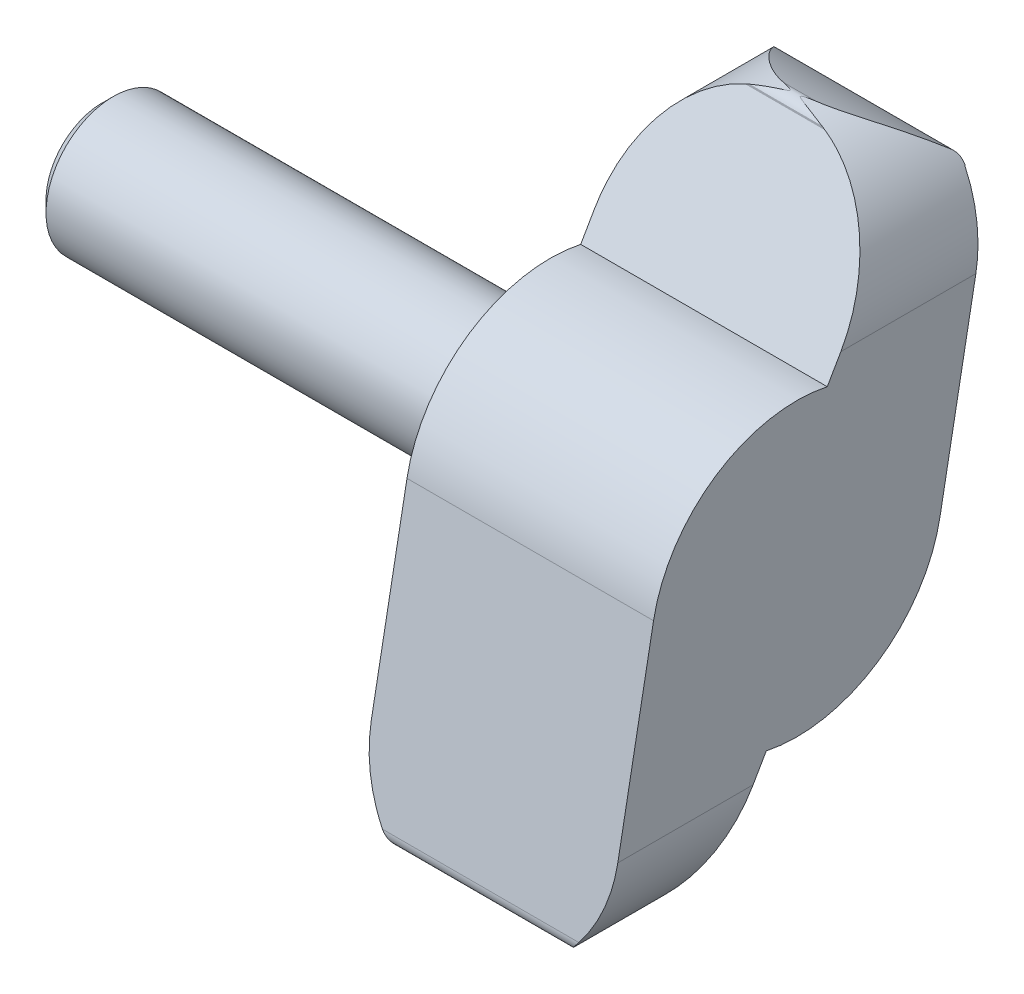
ISO-10303-21;
HEADER;
FILE_DESCRIPTION(('STEP AP214'),'2;1');
FILE_NAME('part.step','',(''),(''),'','','');
FILE_SCHEMA(('AUTOMOTIVE_DESIGN { 1 0 10303 214 1 1 1 1 }'));
ENDSEC;
DATA;
#1=APPLICATION_CONTEXT('core data for automotive mechanical design processes');
#2=APPLICATION_PROTOCOL_DEFINITION('international standard','automotive_design',2000,#1);
#3=PRODUCT_CONTEXT('',#1,'mechanical');
#4=PRODUCT('Part','Part','',(#3));
#5=PRODUCT_RELATED_PRODUCT_CATEGORY('part','',(#4));
#6=PRODUCT_DEFINITION_FORMATION('','',#4);
#7=PRODUCT_DEFINITION_CONTEXT('part definition',#1,'design');
#8=PRODUCT_DEFINITION('design','',#6,#7);
#9=PRODUCT_DEFINITION_SHAPE('','',#8);
#10=(LENGTH_UNIT() NAMED_UNIT(*) SI_UNIT(.MILLI.,.METRE.));
#11=(NAMED_UNIT(*) PLANE_ANGLE_UNIT() SI_UNIT($,.RADIAN.));
#12=(NAMED_UNIT(*) SI_UNIT($,.STERADIAN.) SOLID_ANGLE_UNIT());
#13=UNCERTAINTY_MEASURE_WITH_UNIT(LENGTH_MEASURE(1.E-05),#10,'distance_accuracy_value','');
#14=(GEOMETRIC_REPRESENTATION_CONTEXT(3) GLOBAL_UNCERTAINTY_ASSIGNED_CONTEXT((#13)) GLOBAL_UNIT_ASSIGNED_CONTEXT((#10,
#11,#12)) REPRESENTATION_CONTEXT('',''));
#15=CARTESIAN_POINT('',(0.,0.,0.));
#16=DIRECTION('',(0.,0.,1.));
#17=DIRECTION('',(1.,0.,0.));
#18=AXIS2_PLACEMENT_3D('',#15,#16,#17);
#19=CARTESIAN_POINT('',(0.,12.4051152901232,-5.42760334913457));
#20=DIRECTION('',(1.,0.,0.));
#21=DIRECTION('',(0.,0.,-1.));
#22=AXIS2_PLACEMENT_3D('',#19,#20,#21);
#23=CYLINDRICAL_SURFACE('',#22,0.499999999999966);
#24=CARTESIAN_POINT('',(7.14116420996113,12.6594361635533,-4.99711421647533));
#25=CARTESIAN_POINT('',(7.05910738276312,12.685090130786,-5.01231134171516));
#26=CARTESIAN_POINT('',(6.97678179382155,12.7087161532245,-5.02932196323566));
#27=CARTESIAN_POINT('',(6.81174935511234,12.751964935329,-5.066336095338));
#28=CARTESIAN_POINT('',(6.7290425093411,12.7715877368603,-5.08633957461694));
#29=CARTESIAN_POINT('',(6.56333288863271,12.8068979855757,-5.12872336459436));
#30=CARTESIAN_POINT('',(6.48032992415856,12.8225821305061,-5.15110564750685));
#31=CARTESIAN_POINT('',(6.31425056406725,12.8500433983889,-5.19786498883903));
#32=CARTESIAN_POINT('',(6.23117418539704,12.861821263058,-5.22224166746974));
#33=CARTESIAN_POINT('',(6.10909400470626,12.8763114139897,-5.25985528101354));
#34=CARTESIAN_POINT('',(6.06997976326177,12.880526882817,-5.27217833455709));
#35=CARTESIAN_POINT('',(5.99192272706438,12.8880969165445,-5.2975770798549));
#36=CARTESIAN_POINT('',(5.95297986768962,12.8914518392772,-5.31065245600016));
#37=CARTESIAN_POINT('',(5.89062701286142,12.8961620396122,-5.33300745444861));
#38=CARTESIAN_POINT('',(5.86705949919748,12.8977878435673,-5.34178854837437));
#39=CARTESIAN_POINT('',(5.82898632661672,12.9001716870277,-5.3572028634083));
#40=CARTESIAN_POINT('',(5.81433547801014,12.9010289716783,-5.36343839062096));
#41=CARTESIAN_POINT('',(5.79042978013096,12.9023348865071,-5.3747553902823));
#42=CARTESIAN_POINT('',(5.78102218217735,12.9028238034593,-5.37951637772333));
#43=CARTESIAN_POINT('',(5.76374834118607,12.9036782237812,-5.38941642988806));
#44=CARTESIAN_POINT('',(5.75582992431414,12.9040514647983,-5.39444749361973));
#45=CARTESIAN_POINT('',(5.74684801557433,12.9044580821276,-5.40193499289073));
#46=CARTESIAN_POINT('',(5.74507814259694,12.9045372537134,-5.40351157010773));
#47=CARTESIAN_POINT('',(5.74170356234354,12.9046867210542,-5.40683760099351));
#48=CARTESIAN_POINT('',(5.74009883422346,12.9047570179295,-5.40858703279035));
#49=CARTESIAN_POINT('',(5.73754987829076,12.904867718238,-5.41181200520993));
#50=CARTESIAN_POINT('',(5.73654328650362,12.904911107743,-5.41323735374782));
#51=CARTESIAN_POINT('',(5.73475130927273,12.9049879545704,-5.41622199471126));
#52=CARTESIAN_POINT('',(5.73396538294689,12.9050214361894,-5.41778094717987));
#53=CARTESIAN_POINT('',(5.7328847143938,12.9050673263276,-5.42057891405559));
#54=CARTESIAN_POINT('',(5.73251435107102,12.9050829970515,-5.4217881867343));
#55=CARTESIAN_POINT('',(5.73198040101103,12.9051055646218,-5.42425142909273));
#56=CARTESIAN_POINT('',(5.73181651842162,12.9051124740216,-5.42550533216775));
#57=CARTESIAN_POINT('',(5.7317162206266,12.9051167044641,-5.42802699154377));
#58=CARTESIAN_POINT('',(5.73178060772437,12.9051139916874,-5.4292947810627));
#59=CARTESIAN_POINT('',(5.73212972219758,12.905099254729,-5.43179981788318));
#60=CARTESIAN_POINT('',(5.73241470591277,12.9050872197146,-5.43303702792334));
#61=CARTESIAN_POINT('',(5.73328585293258,12.9050503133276,-5.43581591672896));
#62=CARTESIAN_POINT('',(5.73393694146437,12.9050226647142,-5.43733684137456));
#63=CARTESIAN_POINT('',(5.73546790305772,12.9049572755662,-5.44025773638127));
#64=CARTESIAN_POINT('',(5.73634833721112,12.9049195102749,-5.4416573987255));
#65=CARTESIAN_POINT('',(5.73910487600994,12.9048004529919,-5.44552465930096));
#66=CARTESIAN_POINT('',(5.74117620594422,12.9047100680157,-5.44785026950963));
#67=CARTESIAN_POINT('',(5.74560251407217,12.9045140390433,-5.452210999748));
#68=CARTESIAN_POINT('',(5.74795853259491,12.9044083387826,-5.45424499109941));
#69=CARTESIAN_POINT('',(5.75984612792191,12.9038663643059,-5.4637492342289));
#70=CARTESIAN_POINT('',(5.77038771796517,12.9033597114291,-5.46989348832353));
#71=CARTESIAN_POINT('',(5.79193563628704,12.9022578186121,-5.48125471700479));
#72=CARTESIAN_POINT('',(5.80294463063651,12.9016620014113,-5.48646512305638));
#73=CARTESIAN_POINT('',(5.83600266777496,12.8997704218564,-5.50120183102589));
#74=CARTESIAN_POINT('',(5.85838431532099,12.8983571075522,-5.51000204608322));
#75=CARTESIAN_POINT('',(5.90340070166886,12.8952331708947,-5.52687384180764));
#76=CARTESIAN_POINT('',(5.92603574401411,12.8935221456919,-5.53494441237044));
#77=CARTESIAN_POINT('',(5.993946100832,12.8879621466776,-5.55845123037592));
#78=CARTESIAN_POINT('',(6.03941208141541,12.8836757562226,-5.57325454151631));
#79=CARTESIAN_POINT('',(6.10671196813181,12.8764780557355,-5.59454168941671));
#80=CARTESIAN_POINT('',(6.12850227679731,12.8740157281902,-5.60133738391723));
#81=CARTESIAN_POINT('',(6.17213033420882,12.868820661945,-5.61476598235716));
#82=CARTESIAN_POINT('',(6.1939681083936,12.866087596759,-5.62139867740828));
#83=CARTESIAN_POINT('',(6.21581378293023,12.8632202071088,-5.62795275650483));
#84=B_SPLINE_CURVE_WITH_KNOTS('',3,(#24,#25,#26,#27,#28,#29,#30,#31,#32,#33,#34,#35,#36,#37,#38,
#39,#40,#41,#42,#43,#44,#45,#46,#47,#48,#49,#50,#51,#52,#53,#54,#55,#56,#57,#58,#59,#60,#61,#62,
#63,#64,#65,#66,#67,#68,#69,#70,#71,#72,#73,#74,#75,#76,#77,#78,#79,#80,#81,#82,#83),
.UNSPECIFIED.,.F.,.F.,(4,2,2,2,2,2,2,2,2,2,2,2,2,2,2,2,2,2,2,2,2,2,2,2,2,2,2,2,2,4),(0.,
0.26183696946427,0.523671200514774,0.785724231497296,1.04772747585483,1.17139591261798,
1.29501284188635,1.3706107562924,1.41840721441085,1.45007685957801,1.47807111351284,
1.4851778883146,1.49228376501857,1.4975074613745,1.50271823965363,1.50649771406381,
1.51027176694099,1.51405909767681,1.51785083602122,1.52278652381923,1.52773440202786,
1.53702886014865,1.54635837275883,1.58272187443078,1.61933188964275,1.6915169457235,
1.76380045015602,1.90777020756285,1.97664343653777,2.04560075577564),.UNSPECIFIED.);
#85=CARTESIAN_POINT('',(7.14116420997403,12.6594361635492,-4.99711421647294));
#86=VERTEX_POINT('',#85);
#87=CARTESIAN_POINT('',(6.21581378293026,12.8632202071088,-5.62795275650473));
#88=VERTEX_POINT('',#87);
#89=EDGE_CURVE('E157',#86,#88,#84,.T.);
#90=ORIENTED_EDGE('',*,*,#89,.T.);
#91=DIRECTION('',(1.,0.,0.));
#92=VECTOR('',#91,1.);
#93=CARTESIAN_POINT('',(0.,12.8632202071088,-5.62795275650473));
#94=LINE('',#93,#92);
#95=CARTESIAN_POINT('',(4.78418621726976,12.8632202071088,-5.62795275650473));
#96=VERTEX_POINT('',#95);
#97=EDGE_CURVE('E162',#88,#96,#94,.F.);
#98=ORIENTED_EDGE('',*,*,#97,.T.);
#99=CARTESIAN_POINT('',(4.78418621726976,12.8632202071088,-5.62795275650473));
#100=CARTESIAN_POINT('',(4.81171694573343,12.8668343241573,-5.61968046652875));
#101=CARTESIAN_POINT('',(4.8392449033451,12.8702353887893,-5.61130192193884));
#102=CARTESIAN_POINT('',(4.89427779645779,12.8766138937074,-5.59425518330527));
#103=CARTESIAN_POINT('',(4.9217827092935,12.8795910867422,-5.58558682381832));
#104=CARTESIAN_POINT('',(4.97676674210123,12.8851248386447,-5.56787769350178));
#105=CARTESIAN_POINT('',(5.0042457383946,12.8876806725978,-5.55883631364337));
#106=CARTESIAN_POINT('',(5.05905290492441,12.8923645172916,-5.54021382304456));
#107=CARTESIAN_POINT('',(5.08638111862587,12.894492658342,-5.5306328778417));
#108=CARTESIAN_POINT('',(5.13354679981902,12.8978151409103,-5.5130714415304));
#109=CARTESIAN_POINT('',(5.15346719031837,12.8991079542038,-5.50533117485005));
#110=CARTESIAN_POINT('',(5.18588060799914,12.9010372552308,-5.49156998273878));
#111=CARTESIAN_POINT('',(5.19850968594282,12.901744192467,-5.4859086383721));
#112=CARTESIAN_POINT('',(5.21909592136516,12.9028282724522,-5.47554788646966));
#113=CARTESIAN_POINT('',(5.227212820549,12.9032370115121,-5.47115261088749));
#114=CARTESIAN_POINT('',(5.24282696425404,12.9039893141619,-5.46150992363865));
#115=CARTESIAN_POINT('',(5.25033360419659,12.9043340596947,-5.45628220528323));
#116=CARTESIAN_POINT('',(5.25798544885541,12.9046729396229,-5.44866249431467));
#117=CARTESIAN_POINT('',(5.25918380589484,12.90472555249,-5.4473852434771));
#118=CARTESIAN_POINT('',(5.26144822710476,12.9048243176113,-5.44471260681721));
#119=CARTESIAN_POINT('',(5.26251405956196,12.9048704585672,-5.44331702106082));
#120=CARTESIAN_POINT('',(5.26446527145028,12.9049544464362,-5.44037100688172));
#121=CARTESIAN_POINT('',(5.26534773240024,12.9049921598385,-5.43881858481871));
#122=CARTESIAN_POINT('',(5.26680739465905,12.9050542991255,-5.43557688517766));
#123=CARTESIAN_POINT('',(5.26738597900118,12.9050787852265,-5.43388826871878));
#124=CARTESIAN_POINT('',(5.26801634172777,12.9051054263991,-5.43096330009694));
#125=CARTESIAN_POINT('',(5.26817621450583,12.9051121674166,-5.42975040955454));
#126=CARTESIAN_POINT('',(5.26828332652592,12.9051166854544,-5.42731498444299));
#127=CARTESIAN_POINT('',(5.26823061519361,12.9051144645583,-5.4260924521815));
#128=CARTESIAN_POINT('',(5.26791974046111,12.9051013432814,-5.42367875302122));
#129=CARTESIAN_POINT('',(5.26766223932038,12.9050904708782,-5.42248749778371));
#130=CARTESIAN_POINT('',(5.26697123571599,12.9050612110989,-5.42015773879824));
#131=CARTESIAN_POINT('',(5.26653756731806,12.9050428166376,-5.41901928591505));
#132=CARTESIAN_POINT('',(5.2652028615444,12.9049859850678,-5.41608657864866));
#133=CARTESIAN_POINT('',(5.26418135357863,12.9049422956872,-5.41434785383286));
#134=CARTESIAN_POINT('',(5.26189299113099,12.9048436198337,-5.41104053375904));
#135=CARTESIAN_POINT('',(5.26062527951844,12.9047885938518,-5.40947256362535));
#136=CARTESIAN_POINT('',(5.25551309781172,12.9045645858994,-5.40376002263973));
#137=CARTESIAN_POINT('',(5.25115745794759,12.9043695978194,-5.40008803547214));
#138=CARTESIAN_POINT('',(5.24202942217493,12.90394876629,-5.39330629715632));
#139=CARTESIAN_POINT('',(5.23725404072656,12.9037226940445,-5.39020115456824));
#140=CARTESIAN_POINT('',(5.22154802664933,12.9029573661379,-5.38072935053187));
#141=CARTESIAN_POINT('',(5.2102277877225,12.902373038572,-5.37501484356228));
#142=CARTESIAN_POINT('',(5.1872732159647,12.9011143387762,-5.36425684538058));
#143=CARTESIAN_POINT('',(5.17563808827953,12.9004397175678,-5.35921528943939));
#144=CARTESIAN_POINT('',(5.14052958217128,12.8982900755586,-5.34468104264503));
#145=CARTESIAN_POINT('',(5.11682338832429,12.8966878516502,-5.33576414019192));
#146=CARTESIAN_POINT('',(5.04575404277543,12.8914150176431,-5.31006443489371));
#147=CARTESIAN_POINT('',(4.99811227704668,12.8872626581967,-5.29419486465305));
#148=CARTESIAN_POINT('',(4.90259600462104,12.877670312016,-5.2634495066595));
#149=CARTESIAN_POINT('',(4.85472133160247,12.872229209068,-5.24857459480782));
#150=CARTESIAN_POINT('',(4.75898353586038,12.8600659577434,-5.21959606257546));
#151=CARTESIAN_POINT('',(4.7111205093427,12.8533457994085,-5.2054912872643));
#152=CARTESIAN_POINT('',(4.61541356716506,12.8386140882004,-5.17795972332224));
#153=CARTESIAN_POINT('',(4.5675696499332,12.8306029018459,-5.16453274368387));
#154=CARTESIAN_POINT('',(4.46447709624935,12.8119299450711,-5.13634648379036));
#155=CARTESIAN_POINT('',(4.40923548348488,12.8010496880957,-5.12170529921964));
#156=CARTESIAN_POINT('',(4.29885123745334,12.7775344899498,-5.09347581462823));
#157=CARTESIAN_POINT('',(4.24370861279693,12.7648994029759,-5.07988760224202));
#158=CARTESIAN_POINT('',(4.13349421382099,12.7378406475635,-5.05391031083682));
#159=CARTESIAN_POINT('',(4.07842263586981,12.7234145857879,-5.04152287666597));
#160=CARTESIAN_POINT('',(3.96847200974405,12.6927719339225,-5.01818561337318));
#161=CARTESIAN_POINT('',(3.91359296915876,12.6765552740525,-5.00723584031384));
#162=CARTESIAN_POINT('',(3.85883579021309,12.6594361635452,-4.99711421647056));
#163=B_SPLINE_CURVE_WITH_KNOTS('',3,(#99,#100,#101,#102,#103,#104,#105,#106,#107,#108,#109,#110,
#111,#112,#113,#114,#115,#116,#117,#118,#119,#120,#121,#122,#123,#124,#125,#126,#127,#128,#129,
#130,#131,#132,#133,#134,#135,#136,#137,#138,#139,#140,#141,#142,#143,#144,#145,#146,#147,#148,
#149,#150,#151,#152,#153,#154,#155,#156,#157,#158,#159,#160,#161,#162),.UNSPECIFIED.,.F.,.F.,(4,
2,2,2,2,2,2,2,2,2,2,2,2,2,2,2,2,2,2,2,2,2,2,2,2,2,2,2,2,2,2,4),(0.,0.086919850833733,
0.17389019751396,0.261008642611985,0.348100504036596,0.412326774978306,0.453846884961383,
0.481590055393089,0.508754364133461,0.514003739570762,0.51926216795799,0.524598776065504,
0.529910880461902,0.533563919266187,0.537216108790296,0.540856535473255,0.544500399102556,
0.550516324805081,0.556553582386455,0.573517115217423,0.590612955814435,0.628603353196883,
0.666700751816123,0.742796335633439,0.893922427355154,1.04517989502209,1.19620392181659,
1.34718514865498,1.5216758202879,1.69618099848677,1.87092193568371,2.0456696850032),.UNSPECIFIED.);
#164=CARTESIAN_POINT('',(3.85883579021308,12.6594361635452,-4.99711421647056));
#165=VERTEX_POINT('',#164);
#166=EDGE_CURVE('E20',#96,#165,#163,.T.);
#167=ORIENTED_EDGE('',*,*,#166,.T.);
#168=DIRECTION('',(1.,0.,0.));
#169=VECTOR('',#168,1.);
#170=CARTESIAN_POINT('',(0.,12.6594361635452,-4.99711421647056));
#171=LINE('',#170,#169);
#172=EDGE_CURVE('E177',#86,#165,#171,.F.);
#173=ORIENTED_EDGE('',*,*,#172,.F.);
#174=EDGE_LOOP('',(#90,#98,#167,#173));
#175=FACE_BOUND('',#174,.T.);
#176=ADVANCED_FACE('F16',(#175),#23,.T.);
#177=CARTESIAN_POINT('',(0.,12.6378539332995,-4.98278076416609));
#178=DIRECTION('',(0.,0.553237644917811,0.833023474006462));
#179=DIRECTION('',(0.,-0.833023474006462,0.553237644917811));
#180=AXIS2_PLACEMENT_3D('',#177,#178,#179);
#181=PLANE('',#180);
#182=CARTESIAN_POINT('',(5.5000000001,7.40999999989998,-1.51079505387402));
#183=DIRECTION('',(0.,0.553237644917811,0.833023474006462));
#184=DIRECTION('',(0.,-0.833023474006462,0.553237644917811));
#185=AXIS2_PLACEMENT_3D('',#182,#183,#184);
#186=ELLIPSE('',#185,6.60245499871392,5.5);
#187=CARTESIAN_POINT('',(7.20866709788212,12.6378539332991,-4.9827807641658));
#188=VERTEX_POINT('',#187);
#189=EDGE_CURVE('E171',#188,#86,#186,.T.);
#190=ORIENTED_EDGE('',*,*,#189,.T.);
#191=ORIENTED_EDGE('',*,*,#172,.T.);
#192=CARTESIAN_POINT('',(5.5000000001,7.40999999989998,-1.51079505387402));
#193=DIRECTION('',(0.,0.553237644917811,0.833023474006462));
#194=DIRECTION('',(0.,-0.833023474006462,0.553237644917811));
#195=AXIS2_PLACEMENT_3D('',#192,#193,#194);
#196=ELLIPSE('',#195,6.60245499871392,5.5);
#197=CARTESIAN_POINT('',(3.79133290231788,12.6378539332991,-4.9827807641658));
#198=VERTEX_POINT('',#197);
#199=EDGE_CURVE('E152',#165,#198,#196,.T.);
#200=ORIENTED_EDGE('',*,*,#199,.T.);
#201=DIRECTION('',(1.,0.,0.));
#202=VECTOR('',#201,1.);
#203=CARTESIAN_POINT('',(0.,12.6378539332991,-4.98278076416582));
#204=LINE('',#203,#202);
#205=EDGE_CURVE('E277',#188,#198,#204,.F.);
#206=ORIENTED_EDGE('',*,*,#205,.F.);
#207=EDGE_LOOP('',(#190,#191,#200,#206));
#208=FACE_BOUND('',#207,.T.);
#209=ADVANCED_FACE('F345',(#208),#181,.T.);
#210=CARTESIAN_POINT('',(0.,10.8267878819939,-8.13081344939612));
#211=DIRECTION('',(1.,0.,0.));
#212=DIRECTION('',(0.,0.,-1.));
#213=AXIS2_PLACEMENT_3D('',#210,#211,#212);
#214=CYLINDRICAL_SURFACE('',#213,0.499999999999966);
#215=CARTESIAN_POINT('',(9.88095037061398,10.7352479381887,-8.62236246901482));
#216=CARTESIAN_POINT('',(9.85565785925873,10.768597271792,-8.62854198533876));
#217=CARTESIAN_POINT('',(9.82968852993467,10.8019952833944,-8.63128530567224));
#218=CARTESIAN_POINT('',(9.77690273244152,10.8683029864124,-8.63020181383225));
#219=CARTESIAN_POINT('',(9.75008253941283,10.9012092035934,-8.6263405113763));
#220=CARTESIAN_POINT('',(9.69467659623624,10.9676241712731,-8.61184590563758));
#221=CARTESIAN_POINT('',(9.66608677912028,11.0010387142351,-8.60079853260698));
#222=CARTESIAN_POINT('',(9.60980854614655,11.0653090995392,-8.57166273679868));
#223=CARTESIAN_POINT('',(9.58211734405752,11.0961734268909,-8.55359890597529));
#224=CARTESIAN_POINT('',(9.53849140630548,11.143794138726,-8.51816307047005));
#225=CARTESIAN_POINT('',(9.52194814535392,11.1615945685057,-8.5029353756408));
#226=CARTESIAN_POINT('',(9.4901109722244,11.1954412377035,-8.46942632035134));
#227=CARTESIAN_POINT('',(9.4748199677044,11.211483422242,-8.45113813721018));
#228=CARTESIAN_POINT('',(9.46040585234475,11.226436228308,-8.43128174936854));
#229=B_SPLINE_CURVE_WITH_KNOTS('',3,(#215,#216,#217,#218,#219,#220,#221,#222,#223,#224,#225,
#226,#227,#228),.UNSPECIFIED.,.F.,.F.,(4,2,2,2,2,2,4),(0.,0.126699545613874,0.254062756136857,
0.389505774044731,0.524478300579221,0.61029105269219,0.696297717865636),.UNSPECIFIED.);
#230=CARTESIAN_POINT('',(9.880950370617,10.7352479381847,-8.62236246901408));
#231=VERTEX_POINT('',#230);
#232=CARTESIAN_POINT('',(9.46040585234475,11.2264362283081,-8.43128174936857));
#233=VERTEX_POINT('',#232);
#234=EDGE_CURVE('E318',#231,#233,#229,.T.);
#235=ORIENTED_EDGE('',*,*,#234,.F.);
#236=DIRECTION('',(1.,0.,0.));
#237=VECTOR('',#236,1.);
#238=CARTESIAN_POINT('',(0.,10.7352479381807,-8.62236246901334));
#239=LINE('',#238,#237);
#240=CARTESIAN_POINT('',(1.11904962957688,10.7352479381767,-8.62236246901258));
#241=VERTEX_POINT('',#240);
#242=EDGE_CURVE('E175',#241,#231,#239,.T.);
#243=ORIENTED_EDGE('',*,*,#242,.F.);
#244=CARTESIAN_POINT('',(1.11904962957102,10.7352479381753,-8.62236246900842));
#245=CARTESIAN_POINT('',(1.14434214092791,10.7685972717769,-8.62854198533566));
#246=CARTESIAN_POINT('',(1.17031147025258,10.8019952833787,-8.63128530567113));
#247=CARTESIAN_POINT('',(1.22309726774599,10.8683029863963,-8.63020181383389));
#248=CARTESIAN_POINT('',(1.24991746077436,10.9012092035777,-8.62634051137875));
#249=CARTESIAN_POINT('',(1.30532340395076,10.9676241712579,-8.61184590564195));
#250=CARTESIAN_POINT('',(1.3339132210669,11.0010387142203,-8.60079853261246));
#251=CARTESIAN_POINT('',(1.39019145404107,11.0653090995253,-8.57166273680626));
#252=CARTESIAN_POINT('',(1.41788265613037,11.0961734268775,-8.55359890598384));
#253=CARTESIAN_POINT('',(1.46150859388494,11.1437941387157,-8.51816307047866));
#254=CARTESIAN_POINT('',(1.4780518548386,11.1615945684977,-8.50293537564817));
#255=CARTESIAN_POINT('',(1.50988902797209,11.1954412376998,-8.46942632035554));
#256=CARTESIAN_POINT('',(1.52518003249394,11.2114834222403,-8.45113813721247));
#257=CARTESIAN_POINT('',(1.53959414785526,11.226436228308,-8.43128174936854));
#258=B_SPLINE_CURVE_WITH_KNOTS('',3,(#244,#245,#246,#247,#248,#249,#250,#251,#252,#253,#254,
#255,#256,#257),.UNSPECIFIED.,.F.,.F.,(4,2,2,2,2,2,4),(0.,0.126699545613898,0.254062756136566,
0.389505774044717,0.524478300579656,0.610291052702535,0.696297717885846),.UNSPECIFIED.);
#259=CARTESIAN_POINT('',(1.53959414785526,11.2264362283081,-8.43128174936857));
#260=VERTEX_POINT('',#259);
#261=EDGE_CURVE('E179',#241,#260,#258,.T.);
#262=ORIENTED_EDGE('',*,*,#261,.T.);
#263=DIRECTION('',(1.,0.,0.));
#264=VECTOR('',#263,1.);
#265=CARTESIAN_POINT('',(0.,11.2264362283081,-8.4312817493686));
#266=LINE('',#265,#264);
#267=EDGE_CURVE('E165',#233,#260,#266,.F.);
#268=ORIENTED_EDGE('',*,*,#267,.F.);
#269=EDGE_LOOP('',(#235,#243,#262,#268));
#270=FACE_BOUND('',#269,.T.);
#271=ADVANCED_FACE('F286',(#270),#214,.T.);
#272=CARTESIAN_POINT('',(0.,12.6199846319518,-4.97196000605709));
#273=DIRECTION('',(0.,0.517982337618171,0.855391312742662));
#274=DIRECTION('',(0.,-0.855391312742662,0.517982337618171));
#275=AXIS2_PLACEMENT_3D('',#272,#273,#274);
#276=PLANE('',#275);
#277=CARTESIAN_POINT('',(5.5000000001,7.40999999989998,-1.81705303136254));
#278=DIRECTION('',(0.,0.517982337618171,0.855391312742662));
#279=DIRECTION('',(0.,-0.855391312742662,0.517982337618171));
#280=AXIS2_PLACEMENT_3D('',#277,#278,#279);
#281=ELLIPSE('',#280,6.42980577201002,5.5);
#282=CARTESIAN_POINT('',(7.26240180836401,12.6199846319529,-4.97196000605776));
#283=VERTEX_POINT('',#282);
#284=EDGE_CURVE('E315',#188,#283,#281,.F.);
#285=ORIENTED_EDGE('',*,*,#284,.F.);
#286=ORIENTED_EDGE('',*,*,#205,.T.);
#287=CARTESIAN_POINT('',(5.5000000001,7.40999999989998,-1.81705303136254));
#288=DIRECTION('',(0.,0.517982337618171,0.855391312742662));
#289=DIRECTION('',(0.,-0.855391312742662,0.517982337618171));
#290=AXIS2_PLACEMENT_3D('',#287,#288,#289);
#291=ELLIPSE('',#290,6.42980577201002,5.5);
#292=CARTESIAN_POINT('',(3.737598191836,12.6199846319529,-4.97196000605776));
#293=VERTEX_POINT('',#292);
#294=EDGE_CURVE('E280',#198,#293,#291,.T.);
#295=ORIENTED_EDGE('',*,*,#294,.T.);
#296=DIRECTION('',(1.,0.,0.));
#297=VECTOR('',#296,1.);
#298=CARTESIAN_POINT('',(0.,12.6199846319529,-4.97196000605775));
#299=LINE('',#298,#297);
#300=EDGE_CURVE('E351',#283,#293,#299,.F.);
#301=ORIENTED_EDGE('',*,*,#300,.F.);
#302=EDGE_LOOP('',(#285,#286,#295,#301));
#303=FACE_BOUND('',#302,.T.);
#304=ADVANCED_FACE('F264',(#303),#276,.T.);
#305=CARTESIAN_POINT('',(0.,-12.367276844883,5.41299024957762));
#306=DIRECTION('',(1.,0.,0.));
#307=DIRECTION('',(0.,1.,0.));
#308=AXIS2_PLACEMENT_3D('',#305,#306,#307);
#309=CYLINDRICAL_SURFACE('',#308,0.499999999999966);
#310=CARTESIAN_POINT('',(6.19959886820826,-12.8253241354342,5.61347136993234));
#311=CARTESIAN_POINT('',(6.17278132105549,-12.828763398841,5.60560938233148));
#312=CARTESIAN_POINT('',(6.1459619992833,-12.8320016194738,5.59766386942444));
#313=CARTESIAN_POINT('',(6.09228921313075,-12.8380822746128,5.58156334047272));
#314=CARTESIAN_POINT('',(6.06543577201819,-12.8409240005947,5.5734079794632));
#315=CARTESIAN_POINT('',(6.0106289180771,-12.8463170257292,5.55652475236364));
#316=CARTESIAN_POINT('',(5.98267679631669,-12.8488510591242,5.54778723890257));
#317=CARTESIAN_POINT('',(5.92688418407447,-12.853479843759,5.53000125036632));
#318=CARTESIAN_POINT('',(5.8990435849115,-12.8555753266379,5.52095332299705));
#319=CARTESIAN_POINT('',(5.85585794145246,-12.8584975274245,5.50642411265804));
#320=CARTESIAN_POINT('',(5.84045341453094,-12.8594744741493,5.50114297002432));
#321=CARTESIAN_POINT('',(5.80965911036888,-12.8612975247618,5.49028677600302));
#322=CARTESIAN_POINT('',(5.79426963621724,-12.8621430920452,5.48471063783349));
#323=CARTESIAN_POINT('',(5.76402140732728,-12.8636800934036,5.47312152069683));
#324=CARTESIAN_POINT('',(5.74915812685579,-12.8643741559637,5.46711888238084));
#325=CARTESIAN_POINT('',(5.71981490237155,-12.8656242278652,5.45420177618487));
#326=CARTESIAN_POINT('',(5.70533275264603,-12.8661813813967,5.44729566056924));
#327=CARTESIAN_POINT('',(5.6920960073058,-12.866644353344,5.4381318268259));
#328=CARTESIAN_POINT('',(5.69195050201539,-12.8666494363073,5.43803070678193));
#329=CARTESIAN_POINT('',(5.69165999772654,-12.8666595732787,5.43782775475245));
#330=CARTESIAN_POINT('',(5.6915149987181,-12.8666646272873,5.43772592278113));
#331=CARTESIAN_POINT('',(5.69108073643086,-12.8666797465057,5.43741939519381));
#332=CARTESIAN_POINT('',(5.69079220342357,-12.8666897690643,5.43721366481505));
#333=CARTESIAN_POINT('',(5.68992998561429,-12.8667196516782,5.43659227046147));
#334=CARTESIAN_POINT('',(5.68935941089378,-12.8667393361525,5.43617221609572));
#335=CARTESIAN_POINT('',(5.68766271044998,-12.866797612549,5.4348929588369));
#336=CARTESIAN_POINT('',(5.6865514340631,-12.8668354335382,5.4340145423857));
#337=CARTESIAN_POINT('',(5.68331590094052,-12.8669445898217,5.43130519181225));
#338=CARTESIAN_POINT('',(5.68126206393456,-12.8670125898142,5.42938169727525));
#339=CARTESIAN_POINT('',(5.67862475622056,-12.8670986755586,5.4263670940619));
#340=CARTESIAN_POINT('',(5.67787070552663,-12.8671231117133,5.42542683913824));
#341=CARTESIAN_POINT('',(5.67647417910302,-12.8671681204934,5.42346318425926));
#342=CARTESIAN_POINT('',(5.67583183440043,-12.8671886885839,5.42243968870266));
#343=CARTESIAN_POINT('',(5.67470019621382,-12.8672247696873,5.42028725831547));
#344=CARTESIAN_POINT('',(5.67421352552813,-12.8672401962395,5.41915689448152));
#345=CARTESIAN_POINT('',(5.67347646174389,-12.8672635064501,5.41682219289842));
#346=CARTESIAN_POINT('',(5.6732251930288,-12.867271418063,5.41561814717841));
#347=CARTESIAN_POINT('',(5.67302185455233,-12.867277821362,5.41335027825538));
#348=CARTESIAN_POINT('',(5.67303362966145,-12.8672774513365,5.41228974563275));
#349=CARTESIAN_POINT('',(5.67326650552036,-12.8672701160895,5.41019151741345));
#350=CARTESIAN_POINT('',(5.67348788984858,-12.8672631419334,5.40915385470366));
#351=CARTESIAN_POINT('',(5.67415448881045,-12.8672420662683,5.40697847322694));
#352=CARTESIAN_POINT('',(5.67462896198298,-12.8672270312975,5.40585001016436));
#353=CARTESIAN_POINT('',(5.6757480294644,-12.8671913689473,5.40368175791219));
#354=CARTESIAN_POINT('',(5.67639298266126,-12.8671707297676,5.40264216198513));
#355=CARTESIAN_POINT('',(5.67840715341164,-12.8671058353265,5.39978092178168));
#356=CARTESIAN_POINT('',(5.67991969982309,-12.8670566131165,5.39806218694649));
#357=CARTESIAN_POINT('',(5.68315561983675,-12.866949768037,5.3948378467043));
#358=CARTESIAN_POINT('',(5.6848797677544,-12.8668921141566,5.39333307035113));
#359=CARTESIAN_POINT('',(5.69352231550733,-12.8665985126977,5.38635153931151));
#360=CARTESIAN_POINT('',(5.70118131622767,-12.8663246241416,5.38183542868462));
#361=CARTESIAN_POINT('',(5.71684678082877,-12.8657294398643,5.37348406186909));
#362=CARTESIAN_POINT('',(5.72485526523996,-12.8654078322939,5.36965368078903));
#363=CARTESIAN_POINT('',(5.74890412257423,-12.864387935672,5.35882013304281));
#364=CARTESIAN_POINT('',(5.76519215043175,-12.8636271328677,5.35234796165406));
#365=CARTESIAN_POINT('',(5.79796015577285,-12.8619479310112,5.3399290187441));
#366=CARTESIAN_POINT('',(5.81444036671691,-12.8610293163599,5.33398298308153));
#367=CARTESIAN_POINT('',(5.86388920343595,-12.8580478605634,5.31664250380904));
#368=CARTESIAN_POINT('',(5.897003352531,-12.8557536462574,5.30569193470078));
#369=CARTESIAN_POINT('',(5.99661933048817,-12.8479390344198,5.27353011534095));
#370=CARTESIAN_POINT('',(6.06327828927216,-12.8414915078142,5.25305000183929));
#371=CARTESIAN_POINT('',(6.19666967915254,-12.8261125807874,5.2131848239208));
#372=CARTESIAN_POINT('',(6.26340212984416,-12.817180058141,5.19380025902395));
#373=CARTESIAN_POINT('',(6.39687613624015,-12.7968015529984,5.15614816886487));
#374=CARTESIAN_POINT('',(6.46361762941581,-12.7853529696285,5.13788182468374));
#375=CARTESIAN_POINT('',(6.5969511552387,-12.7599261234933,5.10267206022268));
#376=CARTESIAN_POINT('',(6.66354321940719,-12.7459484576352,5.085728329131));
#377=CARTESIAN_POINT('',(6.80002002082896,-12.7146330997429,5.05258582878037));
#378=CARTESIAN_POINT('',(6.86989428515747,-12.6971576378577,5.03647273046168));
#379=CARTESIAN_POINT('',(7.00926320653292,-12.6593602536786,5.00646208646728));
#380=CARTESIAN_POINT('',(7.07875818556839,-12.639041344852,4.99256222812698));
#381=CARTESIAN_POINT('',(7.14805513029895,-12.6172768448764,4.9799775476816));
#382=B_SPLINE_CURVE_WITH_KNOTS('',3,(#310,#311,#312,#313,#314,#315,#316,#317,#318,#319,#320,
#321,#322,#323,#324,#325,#326,#327,#328,#329,#330,#331,#332,#333,#334,#335,#336,#337,#338,#339,
#340,#341,#342,#343,#344,#345,#346,#347,#348,#349,#350,#351,#352,#353,#354,#355,#356,#357,#358,
#359,#360,#361,#362,#363,#364,#365,#366,#367,#368,#369,#370,#371,#372,#373,#374,#375,#376,#377,
#378,#379,#380,#381),.UNSPECIFIED.,.F.,.F.,(4,2,2,2,2,2,2,2,2,2,2,2,2,2,2,2,2,2,2,2,2,2,2,2,2,2,
2,2,2,2,2,2,2,2,2,4),(0.,0.0844711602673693,0.169091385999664,0.257274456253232,
0.345309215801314,0.394255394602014,0.443396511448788,0.49160185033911,0.539389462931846,
0.539921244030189,0.540453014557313,0.541516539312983,0.543642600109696,0.547894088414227,
0.556296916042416,0.559907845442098,0.563522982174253,0.567196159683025,0.570855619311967,
0.574015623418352,0.577179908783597,0.580832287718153,0.584492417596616,0.591324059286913,
0.598181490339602,0.624668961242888,0.651337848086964,0.703904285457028,0.756543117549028,
0.861378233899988,1.07141872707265,1.28155422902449,1.49190798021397,1.70221214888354,
1.9235455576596,2.14464615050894),.UNSPECIFIED.);
#383=CARTESIAN_POINT('',(6.19959886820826,-12.8253241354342,5.61347136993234));
#384=VERTEX_POINT('',#383);
#385=CARTESIAN_POINT('',(7.14805513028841,-12.6172768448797,4.97997754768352));
#386=VERTEX_POINT('',#385);
#387=EDGE_CURVE('E247',#384,#386,#382,.T.);
#388=ORIENTED_EDGE('',*,*,#387,.F.);
#389=DIRECTION('',(1.,0.,0.));
#390=VECTOR('',#389,1.);
#391=CARTESIAN_POINT('',(0.,-12.8253241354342,5.61347136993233));
#392=LINE('',#391,#390);
#393=CARTESIAN_POINT('',(4.80040113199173,-12.8253241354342,5.61347136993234));
#394=VERTEX_POINT('',#393);
#395=EDGE_CURVE('E276',#384,#394,#392,.F.);
#396=ORIENTED_EDGE('',*,*,#395,.T.);
#397=CARTESIAN_POINT('',(4.80040113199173,-12.8253241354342,5.61347136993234));
#398=CARTESIAN_POINT('',(4.82721867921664,-12.8287633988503,5.60560938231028));
#399=CARTESIAN_POINT('',(4.85403800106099,-12.8320016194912,5.59766386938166));
#400=CARTESIAN_POINT('',(4.90771078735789,-12.8380822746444,5.5815633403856));
#401=CARTESIAN_POINT('',(4.93456422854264,-12.8409240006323,5.57340797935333));
#402=CARTESIAN_POINT('',(4.98937108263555,-12.8463170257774,5.55652475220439));
#403=CARTESIAN_POINT('',(5.01732320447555,-12.8488510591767,5.54778723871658));
#404=CARTESIAN_POINT('',(5.07311581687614,-12.8534798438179,5.53000125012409));
#405=CARTESIAN_POINT('',(5.10095641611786,-12.8555753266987,5.52095332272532));
#406=CARTESIAN_POINT('',(5.14414205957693,-12.858497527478,5.50642411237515));
#407=CARTESIAN_POINT('',(5.15954658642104,-12.8594744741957,5.50114296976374));
#408=CARTESIAN_POINT('',(5.1903408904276,-12.8612975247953,5.49028677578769));
#409=CARTESIAN_POINT('',(5.20573036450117,-12.8621430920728,5.4847106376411));
#410=CARTESIAN_POINT('',(5.2359785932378,-12.8636800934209,5.47312152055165));
#411=CARTESIAN_POINT('',(5.25084187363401,-12.8643741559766,5.46711888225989));
#412=CARTESIAN_POINT('',(5.28018509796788,-12.8656242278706,5.45420177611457));
#413=CARTESIAN_POINT('',(5.29466724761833,-12.866181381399,5.44729566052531));
#414=CARTESIAN_POINT('',(5.30790399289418,-12.866644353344,5.43813182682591));
#415=CARTESIAN_POINT('',(5.3080494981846,-12.8666494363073,5.43803070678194));
#416=CARTESIAN_POINT('',(5.30834000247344,-12.8666595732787,5.43782775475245));
#417=CARTESIAN_POINT('',(5.30848500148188,-12.8666646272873,5.43772592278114));
#418=CARTESIAN_POINT('',(5.30891926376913,-12.8666797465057,5.43741939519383));
#419=CARTESIAN_POINT('',(5.30920779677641,-12.8666897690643,5.43721366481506));
#420=CARTESIAN_POINT('',(5.31007001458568,-12.8667196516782,5.43659227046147));
#421=CARTESIAN_POINT('',(5.31064058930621,-12.8667393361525,5.43617221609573));
#422=CARTESIAN_POINT('',(5.31233728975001,-12.866797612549,5.43489295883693));
#423=CARTESIAN_POINT('',(5.31344856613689,-12.8668354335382,5.43401454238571));
#424=CARTESIAN_POINT('',(5.31668409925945,-12.8669445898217,5.43130519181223));
#425=CARTESIAN_POINT('',(5.31873793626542,-12.8670125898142,5.42938169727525));
#426=CARTESIAN_POINT('',(5.32137524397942,-12.8670986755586,5.4263670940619));
#427=CARTESIAN_POINT('',(5.32212929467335,-12.8671231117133,5.42542683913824));
#428=CARTESIAN_POINT('',(5.32352582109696,-12.8671681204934,5.42346318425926));
#429=CARTESIAN_POINT('',(5.32416816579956,-12.8671886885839,5.42243968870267));
#430=CARTESIAN_POINT('',(5.32529980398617,-12.8672247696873,5.42028725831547));
#431=CARTESIAN_POINT('',(5.32578647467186,-12.8672401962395,5.41915689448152));
#432=CARTESIAN_POINT('',(5.3265235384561,-12.8672635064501,5.41682219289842));
#433=CARTESIAN_POINT('',(5.32677480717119,-12.867271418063,5.4156181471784));
#434=CARTESIAN_POINT('',(5.32697814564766,-12.867277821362,5.41335027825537));
#435=CARTESIAN_POINT('',(5.32696637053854,-12.8672774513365,5.41228974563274));
#436=CARTESIAN_POINT('',(5.32673349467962,-12.8672701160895,5.41019151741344));
#437=CARTESIAN_POINT('',(5.32651211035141,-12.8672631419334,5.40915385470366));
#438=CARTESIAN_POINT('',(5.32584551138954,-12.8672420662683,5.40697847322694));
#439=CARTESIAN_POINT('',(5.325371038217,-12.8672270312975,5.40585001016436));
#440=CARTESIAN_POINT('',(5.32425197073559,-12.8671913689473,5.40368175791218));
#441=CARTESIAN_POINT('',(5.32360701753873,-12.8671707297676,5.40264216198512));
#442=CARTESIAN_POINT('',(5.32159284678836,-12.8671058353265,5.39978092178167));
#443=CARTESIAN_POINT('',(5.3200803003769,-12.8670566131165,5.39806218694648));
#444=CARTESIAN_POINT('',(5.31684438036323,-12.866949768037,5.3948378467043));
#445=CARTESIAN_POINT('',(5.31512023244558,-12.8668921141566,5.39333307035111));
#446=CARTESIAN_POINT('',(5.30647768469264,-12.8665985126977,5.38635153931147));
#447=CARTESIAN_POINT('',(5.29881868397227,-12.8663246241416,5.38183542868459));
#448=CARTESIAN_POINT('',(5.28315321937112,-12.8657294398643,5.37348406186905));
#449=CARTESIAN_POINT('',(5.2751447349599,-12.8654078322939,5.36965368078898));
#450=CARTESIAN_POINT('',(5.25109587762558,-12.8643879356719,5.35882013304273));
#451=CARTESIAN_POINT('',(5.23480784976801,-12.8636271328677,5.35234796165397));
#452=CARTESIAN_POINT('',(5.20203984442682,-12.8619479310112,5.33992901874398));
#453=CARTESIAN_POINT('',(5.18555963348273,-12.8610293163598,5.3339829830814));
#454=CARTESIAN_POINT('',(5.13611079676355,-12.8580478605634,5.31664250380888));
#455=CARTESIAN_POINT('',(5.10299664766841,-12.8557536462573,5.30569193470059));
#456=CARTESIAN_POINT('',(5.00338066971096,-12.8479390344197,5.27353011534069));
#457=CARTESIAN_POINT('',(4.9367217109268,-12.8414915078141,5.25305000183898));
#458=CARTESIAN_POINT('',(4.80333032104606,-12.8261125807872,5.21318482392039));
#459=CARTESIAN_POINT('',(4.73659787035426,-12.8171800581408,5.1938002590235));
#460=CARTESIAN_POINT('',(4.60312386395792,-12.7968015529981,5.15614816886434));
#461=CARTESIAN_POINT('',(4.53638237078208,-12.7853529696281,5.13788182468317));
#462=CARTESIAN_POINT('',(4.40304884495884,-12.7599261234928,5.10267206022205));
#463=CARTESIAN_POINT('',(4.33645678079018,-12.7459484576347,5.08572832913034));
#464=CARTESIAN_POINT('',(4.19997997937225,-12.7146330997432,5.0525858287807));
#465=CARTESIAN_POINT('',(4.13010571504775,-12.697157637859,5.03647273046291));
#466=CARTESIAN_POINT('',(3.99073679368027,-12.6593602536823,5.00646208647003));
#467=CARTESIAN_POINT('',(3.92124181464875,-12.6390413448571,4.99256222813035));
#468=CARTESIAN_POINT('',(3.85194486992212,-12.617276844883,4.97997754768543));
#469=B_SPLINE_CURVE_WITH_KNOTS('',3,(#397,#398,#399,#400,#401,#402,#403,#404,#405,#406,#407,
#408,#409,#410,#411,#412,#413,#414,#415,#416,#417,#418,#419,#420,#421,#422,#423,#424,#425,#426,
#427,#428,#429,#430,#431,#432,#433,#434,#435,#436,#437,#438,#439,#440,#441,#442,#443,#444,#445,
#446,#447,#448,#449,#450,#451,#452,#453,#454,#455,#456,#457,#458,#459,#460,#461,#462,#463,#464,
#465,#466,#467,#468),.UNSPECIFIED.,.F.,.F.,(4,2,2,2,2,2,2,2,2,2,2,2,2,2,2,2,2,2,2,2,2,2,2,2,2,2,
2,2,2,2,2,2,2,2,2,4),(0.,0.0844711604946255,0.169091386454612,0.257274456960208,
0.345309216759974,0.394255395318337,0.443396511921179,0.491601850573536,0.539389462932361,
0.539921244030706,0.54045301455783,0.541516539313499,0.543642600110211,0.547894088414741,
0.556296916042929,0.559907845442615,0.563522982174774,0.567196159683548,0.570855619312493,
0.57401562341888,0.577179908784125,0.580832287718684,0.584492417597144,0.591324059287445,
0.598181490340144,0.624668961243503,0.651337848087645,0.703904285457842,0.756543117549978,
0.861378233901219,1.07141872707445,1.28155422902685,1.49190798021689,1.702212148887,
1.92354555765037,2.14464615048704),.UNSPECIFIED.);
#470=CARTESIAN_POINT('',(3.85194486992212,-12.617276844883,4.97997754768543));
#471=VERTEX_POINT('',#470);
#472=EDGE_CURVE('E270',#394,#471,#469,.T.);
#473=ORIENTED_EDGE('',*,*,#472,.T.);
#474=DIRECTION('',(1.,0.,0.));
#475=VECTOR('',#474,1.);
#476=CARTESIAN_POINT('',(0.,-12.617276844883,4.97997754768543));
#477=LINE('',#476,#475);
#478=EDGE_CURVE('E230',#386,#471,#477,.F.);
#479=ORIENTED_EDGE('',*,*,#478,.F.);
#480=EDGE_LOOP('',(#388,#396,#473,#479));
#481=FACE_BOUND('',#480,.T.);
#482=ADVANCED_FACE('F258',(#481),#309,.T.);
#483=CARTESIAN_POINT('',(0.,10.7352479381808,-8.62236246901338));
#484=DIRECTION('',(0.,-0.535714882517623,-0.844398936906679));
#485=DIRECTION('',(0.,0.844398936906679,-0.535714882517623));
#486=AXIS2_PLACEMENT_3D('',#483,#484,#485);
#487=PLANE('',#486);
#488=CARTESIAN_POINT('',(5.5000000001,7.40999999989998,-6.512714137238));
#489=DIRECTION('',(0.,-0.535714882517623,-0.844398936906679));
#490=DIRECTION('',(0.,-0.844398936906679,0.535714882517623));
#491=AXIS2_PLACEMENT_3D('',#488,#489,#490);
#492=ELLIPSE('',#491,6.513508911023,5.5);
#493=CARTESIAN_POINT('',(9.90748227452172,10.7,-8.60000000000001));
#494=VERTEX_POINT('',#493);
#495=EDGE_CURVE('E322',#494,#231,#492,.F.);
#496=ORIENTED_EDGE('',*,*,#495,.F.);
#497=DIRECTION('',(1.,0.,0.));
#498=VECTOR('',#497,1.);
#499=CARTESIAN_POINT('',(0.,10.7,-8.6));
#500=LINE('',#499,#498);
#501=CARTESIAN_POINT('',(1.09251772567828,10.7,-8.60000000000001));
#502=VERTEX_POINT('',#501);
#503=EDGE_CURVE('E370',#502,#494,#500,.T.);
#504=ORIENTED_EDGE('',*,*,#503,.F.);
#505=CARTESIAN_POINT('',(5.5000000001,7.40999999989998,-6.512714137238));
#506=DIRECTION('',(0.,-0.535714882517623,-0.844398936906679));
#507=DIRECTION('',(0.,-0.844398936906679,0.535714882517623));
#508=AXIS2_PLACEMENT_3D('',#505,#506,#507);
#509=ELLIPSE('',#508,6.513508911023,5.5);
#510=EDGE_CURVE('E278',#502,#241,#509,.T.);
#511=ORIENTED_EDGE('',*,*,#510,.T.);
#512=ORIENTED_EDGE('',*,*,#242,.T.);
#513=EDGE_LOOP('',(#496,#504,#511,#512));
#514=FACE_BOUND('',#513,.T.);
#515=ADVANCED_FACE('F263',(#514),#487,.T.);
#516=CARTESIAN_POINT('',(5.5000000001,7.40999999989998,-13.6));
#517=DIRECTION('',(0.,0.,1.));
#518=DIRECTION('',(1.,0.,0.));
#519=AXIS2_PLACEMENT_3D('',#516,#517,#518);
#520=CYLINDRICAL_SURFACE('',#519,5.5);
#521=CARTESIAN_POINT('',(5.5000000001,7.40999999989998,-1.96397397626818));
#522=DIRECTION('',(0.,0.500000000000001,0.866025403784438));
#523=DIRECTION('',(0.,-0.866025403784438,0.500000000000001));
#524=AXIS2_PLACEMENT_3D('',#521,#522,#523);
#525=ELLIPSE('',#524,6.35085296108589,5.5);
#526=CARTESIAN_POINT('',(11.00000000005,7.40999999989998,-1.96397397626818));
#527=VERTEX_POINT('',#526);
#528=EDGE_CURVE('E316',#527,#283,#525,.T.);
#529=ORIENTED_EDGE('',*,*,#528,.F.);
#530=DIRECTION('',(0.,0.,-1.));
#531=VECTOR('',#530,1.);
#532=CARTESIAN_POINT('',(11.,7.40999999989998,-0.005559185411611));
#533=LINE('',#532,#531);
#534=CARTESIAN_POINT('',(11.00000000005,7.40999999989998,-7.98731153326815));
#535=VERTEX_POINT('',#534);
#536=EDGE_CURVE('E335',#535,#527,#533,.F.);
#537=ORIENTED_EDGE('',*,*,#536,.F.);
#538=CARTESIAN_POINT('',(5.5000000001,7.40999999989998,-7.98731153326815));
#539=DIRECTION('',(0.,-0.183079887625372,-0.983098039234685));
#540=DIRECTION('',(0.,-0.983098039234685,0.183079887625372));
#541=AXIS2_PLACEMENT_3D('',#538,#539,#540);
#542=ELLIPSE('',#541,5.59455901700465,5.5);
#543=EDGE_CURVE('E377',#494,#535,#542,.T.);
#544=ORIENTED_EDGE('',*,*,#543,.F.);
#545=ORIENTED_EDGE('',*,*,#495,.T.);
#546=ORIENTED_EDGE('',*,*,#234,.T.);
#547=CARTESIAN_POINT('',(6.21581378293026,12.8632202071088,-5.62795275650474));
#548=CARTESIAN_POINT('',(6.32275312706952,12.8491781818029,-5.66006963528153));
#549=CARTESIAN_POINT('',(6.42716575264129,12.8322783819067,-5.69837907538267));
#550=CARTESIAN_POINT('',(6.63042152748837,12.7935688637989,-5.78478320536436));
#551=CARTESIAN_POINT('',(6.72928616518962,12.7717799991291,-5.83283625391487));
#552=CARTESIAN_POINT('',(6.92059949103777,12.7242729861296,-5.93577682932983));
#553=CARTESIAN_POINT('',(7.01311390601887,12.6986084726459,-5.99056941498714));
#554=CARTESIAN_POINT('',(7.1935602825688,12.6436175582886,-6.1057955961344));
#555=CARTESIAN_POINT('',(7.28148612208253,12.6142864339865,-6.16623644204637));
#556=CARTESIAN_POINT('',(7.51734411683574,12.5291626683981,-6.33819946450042));
#557=CARTESIAN_POINT('',(7.66088751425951,12.4700068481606,-6.45407032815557));
#558=CARTESIAN_POINT('',(7.93696089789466,12.3429801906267,-6.6937717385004));
#559=CARTESIAN_POINT('',(8.06948586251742,12.2751054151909,-6.81760586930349));
#560=CARTESIAN_POINT('',(8.32620281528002,12.1306415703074,-7.07139536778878));
#561=CARTESIAN_POINT('',(8.45030788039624,12.0539787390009,-7.20139622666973));
#562=CARTESIAN_POINT('',(8.68982647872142,11.8928361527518,-7.46437155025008));
#563=CARTESIAN_POINT('',(8.80524344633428,11.8083595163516,-7.59734481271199));
#564=CARTESIAN_POINT('',(9.0136710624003,11.6431374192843,-7.8476269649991));
#565=CARTESIAN_POINT('',(9.10765114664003,11.5633172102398,-7.96474292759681));
#566=CARTESIAN_POINT('',(9.28879379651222,11.3987098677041,-8.19836015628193));
#567=CARTESIAN_POINT('',(9.37601394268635,11.3139788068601,-8.31485626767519));
#568=CARTESIAN_POINT('',(9.4604058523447,11.2264362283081,-8.43128174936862));
#569=B_SPLINE_CURVE_WITH_KNOTS('',3,(#547,#548,#549,#550,#551,#552,#553,#554,#555,#556,#557,
#558,#559,#560,#561,#562,#563,#564,#565,#566,#567,#568),.UNSPECIFIED.,.F.,.F.,(4,2,2,2,2,2,2,2,
2,2,4),(0.,0.336980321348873,0.672549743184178,1.00384107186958,1.33556366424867,
1.91577887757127,2.4962570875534,3.08202405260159,3.66755823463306,4.17753265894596,
4.68253035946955),.UNSPECIFIED.);
#570=EDGE_CURVE('E309',#88,#233,#569,.T.);
#571=ORIENTED_EDGE('',*,*,#570,.F.);
#572=ORIENTED_EDGE('',*,*,#89,.F.);
#573=ORIENTED_EDGE('',*,*,#189,.F.);
#574=ORIENTED_EDGE('',*,*,#284,.T.);
#575=EDGE_LOOP('',(#529,#537,#544,#545,#546,#571,#572,#573,#574));
#576=FACE_BOUND('',#575,.T.);
#577=ADVANCED_FACE('F305',(#576),#520,.T.);
#578=CARTESIAN_POINT('',(0.,0.036282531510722,-0.018169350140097));
#579=DIRECTION('',(1.,0.,0.));
#580=DIRECTION('',(0.,0.,-1.));
#581=AXIS2_PLACEMENT_3D('',#578,#579,#580);
#582=CYLINDRICAL_SURFACE('',#581,14.);
#583=ORIENTED_EDGE('',*,*,#570,.T.);
#584=ORIENTED_EDGE('',*,*,#267,.T.);
#585=CARTESIAN_POINT('',(4.78418621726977,12.8632202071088,-5.62795275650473));
#586=CARTESIAN_POINT('',(4.6772468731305,12.8491781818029,-5.66006963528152));
#587=CARTESIAN_POINT('',(4.57283424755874,12.8322783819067,-5.69837907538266));
#588=CARTESIAN_POINT('',(4.36957847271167,12.7935688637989,-5.78478320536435));
#589=CARTESIAN_POINT('',(4.27071383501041,12.7717799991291,-5.83283625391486));
#590=CARTESIAN_POINT('',(4.07940050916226,12.7242729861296,-5.93577682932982));
#591=CARTESIAN_POINT('',(3.98688609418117,12.6986084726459,-5.99056941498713));
#592=CARTESIAN_POINT('',(3.80643971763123,12.6436175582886,-6.10579559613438));
#593=CARTESIAN_POINT('',(3.71851387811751,12.6142864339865,-6.16623644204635));
#594=CARTESIAN_POINT('',(3.4826558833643,12.5291626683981,-6.3381994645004));
#595=CARTESIAN_POINT('',(3.33911248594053,12.4700068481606,-6.45407032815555));
#596=CARTESIAN_POINT('',(3.06303910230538,12.3429801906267,-6.69377173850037));
#597=CARTESIAN_POINT('',(2.93051413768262,12.2751054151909,-6.81760586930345));
#598=CARTESIAN_POINT('',(2.67379718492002,12.1306415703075,-7.07139536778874));
#599=CARTESIAN_POINT('',(2.54969211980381,12.0539787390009,-7.20139622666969));
#600=CARTESIAN_POINT('',(2.31017352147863,11.8928361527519,-7.46437155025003));
#601=CARTESIAN_POINT('',(2.19475655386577,11.8083595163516,-7.59734481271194));
#602=CARTESIAN_POINT('',(1.98632893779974,11.6431374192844,-7.84762696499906));
#603=CARTESIAN_POINT('',(1.89234885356,11.5633172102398,-7.96474292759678));
#604=CARTESIAN_POINT('',(1.7112062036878,11.3987098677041,-8.19836015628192));
#605=CARTESIAN_POINT('',(1.62398605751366,11.3139788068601,-8.31485626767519));
#606=CARTESIAN_POINT('',(1.53959414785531,11.2264362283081,-8.43128174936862));
#607=B_SPLINE_CURVE_WITH_KNOTS('',3,(#585,#586,#587,#588,#589,#590,#591,#592,#593,#594,#595,
#596,#597,#598,#599,#600,#601,#602,#603,#604,#605,#606),.UNSPECIFIED.,.F.,.F.,(4,2,2,2,2,2,2,2,
2,2,4),(0.,0.33698032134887,0.672549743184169,1.00384107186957,1.33556366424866,
1.91577887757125,2.49625708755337,3.08202405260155,3.667558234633,4.17753265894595,
4.68253035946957),.UNSPECIFIED.);
#608=EDGE_CURVE('E150',#96,#260,#607,.T.);
#609=ORIENTED_EDGE('',*,*,#608,.F.);
#610=ORIENTED_EDGE('',*,*,#97,.F.);
#611=EDGE_LOOP('',(#583,#584,#609,#610));
#612=FACE_BOUND('',#611,.T.);
#613=ADVANCED_FACE('F161',(#612),#582,.T.);
#614=CARTESIAN_POINT('',(0.,8.24672296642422,-2.44705620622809));
#615=DIRECTION('',(0.,0.500000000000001,0.866025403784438));
#616=DIRECTION('',(0.,-0.866025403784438,0.500000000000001));
#617=AXIS2_PLACEMENT_3D('',#614,#615,#616);
#618=PLANE('',#617);
#619=ORIENTED_EDGE('',*,*,#528,.T.);
#620=ORIENTED_EDGE('',*,*,#300,.T.);
#621=CARTESIAN_POINT('',(5.5000000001,7.40999999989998,-1.96397397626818));
#622=DIRECTION('',(0.,0.500000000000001,0.866025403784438));
#623=DIRECTION('',(0.,-0.866025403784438,0.500000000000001));
#624=AXIS2_PLACEMENT_3D('',#621,#622,#623);
#625=ELLIPSE('',#624,6.35085296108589,5.5);
#626=CARTESIAN_POINT('',(5.00029705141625E-11,7.40999999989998,-1.96397397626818));
#627=VERTEX_POINT('',#626);
#628=EDGE_CURVE('E167',#627,#293,#625,.F.);
#629=ORIENTED_EDGE('',*,*,#628,.F.);
#630=DIRECTION('',(0.,-0.866025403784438,0.500000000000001));
#631=VECTOR('',#630,1.);
#632=CARTESIAN_POINT('',(0.,8.24672296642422,-2.44705620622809));
#633=LINE('',#632,#631);
#634=CARTESIAN_POINT('',(0.,6.35687896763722,-1.35595426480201));
#635=VERTEX_POINT('',#634);
#636=EDGE_CURVE('E347',#627,#635,#633,.T.);
#637=ORIENTED_EDGE('',*,*,#636,.T.);
#638=DIRECTION('',(1.,0.,0.));
#639=VECTOR('',#638,1.);
#640=CARTESIAN_POINT('',(0.,6.35687896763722,-1.35595426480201));
#641=LINE('',#640,#639);
#642=CARTESIAN_POINT('',(11.,6.35687896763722,-1.35595426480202));
#643=VERTEX_POINT('',#642);
#644=EDGE_CURVE('E382',#643,#635,#641,.F.);
#645=ORIENTED_EDGE('',*,*,#644,.F.);
#646=DIRECTION('',(0.,-0.866025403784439,0.5));
#647=VECTOR('',#646,1.);
#648=CARTESIAN_POINT('',(11.,7.40999999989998,-1.96397397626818));
#649=LINE('',#648,#647);
#650=EDGE_CURVE('E355',#527,#643,#649,.T.);
#651=ORIENTED_EDGE('',*,*,#650,.F.);
#652=EDGE_LOOP('',(#619,#620,#629,#637,#645,#651));
#653=FACE_BOUND('',#652,.T.);
#654=ADVANCED_FACE('F304',(#653),#618,.T.);
#655=CARTESIAN_POINT('',(0.,-10.7876120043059,8.11649106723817));
#656=DIRECTION('',(1.,0.,0.));
#657=DIRECTION('',(0.,1.,0.));
#658=AXIS2_PLACEMENT_3D('',#655,#656,#657);
#659=CYLINDRICAL_SURFACE('',#658,0.499999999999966);
#660=CARTESIAN_POINT('',(9.88032471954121,-10.6960720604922,8.6080400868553));
#661=CARTESIAN_POINT('',(9.85502610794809,-10.7294163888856,8.61421865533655));
#662=CARTESIAN_POINT('',(9.82905082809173,-10.7628091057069,8.61696205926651));
#663=CARTESIAN_POINT('',(9.77625309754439,-10.8291062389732,8.61588081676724));
#664=CARTESIAN_POINT('',(9.74942692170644,-10.8620071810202,8.61202168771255));
#665=CARTESIAN_POINT('',(9.6939998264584,-10.9284221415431,8.59753151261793));
#666=CARTESIAN_POINT('',(9.66539480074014,-10.9618415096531,8.58648440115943));
#667=CARTESIAN_POINT('',(9.6090861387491,-11.0261213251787,8.55734715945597));
#668=CARTESIAN_POINT('',(9.58137971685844,-11.0569902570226,8.53928162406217));
#669=CARTESIAN_POINT('',(9.5377520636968,-11.1045934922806,8.50385932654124));
#670=CARTESIAN_POINT('',(9.52122096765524,-11.122373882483,8.48865144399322));
#671=CARTESIAN_POINT('',(9.48940483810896,-11.1561852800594,8.45518907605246));
#672=CARTESIAN_POINT('',(9.47412268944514,-11.1722122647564,8.43692781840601));
#673=CARTESIAN_POINT('',(9.45971482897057,-11.1871531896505,8.41710184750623));
#674=B_SPLINE_CURVE_WITH_KNOTS('',3,(#660,#661,#662,#663,#664,#665,#666,#667,#668,#669,#670,
#671,#672,#673),.UNSPECIFIED.,.F.,.F.,(4,2,2,2,2,2,4),(0.,0.126698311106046,0.254060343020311,
0.389542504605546,0.524554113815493,0.610277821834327,0.696194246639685),.UNSPECIFIED.);
#675=CARTESIAN_POINT('',(9.88032471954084,-10.6960720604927,8.60804008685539));
#676=VERTEX_POINT('',#675);
#677=CARTESIAN_POINT('',(9.45971482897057,-11.1871531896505,8.41710184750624));
#678=VERTEX_POINT('',#677);
#679=EDGE_CURVE('E253',#676,#678,#674,.T.);
#680=ORIENTED_EDGE('',*,*,#679,.F.);
#681=DIRECTION('',(1.,0.,0.));
#682=VECTOR('',#681,1.);
#683=CARTESIAN_POINT('',(0.,-10.6960720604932,8.60804008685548));
#684=LINE('',#683,#682);
#685=CARTESIAN_POINT('',(1.11967528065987,-10.6960720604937,8.60804008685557));
#686=VERTEX_POINT('',#685);
#687=EDGE_CURVE('E385',#686,#676,#684,.T.);
#688=ORIENTED_EDGE('',*,*,#687,.F.);
#689=CARTESIAN_POINT('',(1.11967528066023,-10.6960720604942,8.60804008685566));
#690=CARTESIAN_POINT('',(1.14497389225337,-10.7294163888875,8.61421865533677));
#691=CARTESIAN_POINT('',(1.17094917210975,-10.7628091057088,8.61696205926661));
#692=CARTESIAN_POINT('',(1.22374690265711,-10.8291062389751,8.61588081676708));
#693=CARTESIAN_POINT('',(1.25057307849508,-10.8620071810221,8.61202168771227));
#694=CARTESIAN_POINT('',(1.30600017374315,-10.928422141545,8.59753151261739));
#695=CARTESIAN_POINT('',(1.33460519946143,-10.9618415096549,8.58648440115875));
#696=CARTESIAN_POINT('',(1.3909138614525,-11.0261213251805,8.557347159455));
#697=CARTESIAN_POINT('',(1.41862028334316,-11.0569902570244,8.53928162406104));
#698=CARTESIAN_POINT('',(1.46224793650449,-11.104593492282,8.50385932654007));
#699=CARTESIAN_POINT('',(1.47877903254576,-11.1223738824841,8.48865144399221));
#700=CARTESIAN_POINT('',(1.5105951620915,-11.1561852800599,8.45518907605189));
#701=CARTESIAN_POINT('',(1.52587731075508,-11.1722122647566,8.43692781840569));
#702=CARTESIAN_POINT('',(1.54028517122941,-11.1871531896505,8.41710184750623));
#703=B_SPLINE_CURVE_WITH_KNOTS('',3,(#689,#690,#691,#692,#693,#694,#695,#696,#697,#698,#699,
#700,#701,#702),.UNSPECIFIED.,.F.,.F.,(4,2,2,2,2,2,4),(0.,0.126698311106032,0.254060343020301,
0.389542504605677,0.524554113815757,0.610277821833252,0.696194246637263),.UNSPECIFIED.);
#704=CARTESIAN_POINT('',(1.54028517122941,-11.1871531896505,8.41710184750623));
#705=VERTEX_POINT('',#704);
#706=EDGE_CURVE('E353',#686,#705,#703,.T.);
#707=ORIENTED_EDGE('',*,*,#706,.T.);
#708=DIRECTION('',(1.,0.,0.));
#709=VECTOR('',#708,1.);
#710=CARTESIAN_POINT('',(0.,-11.1871531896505,8.41710184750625));
#711=LINE('',#710,#709);
#712=EDGE_CURVE('E229',#678,#705,#711,.F.);
#713=ORIENTED_EDGE('',*,*,#712,.F.);
#714=EDGE_LOOP('',(#680,#688,#707,#713));
#715=FACE_BOUND('',#714,.T.);
#716=ADVANCED_FACE('F240',(#715),#659,.T.);
#717=CARTESIAN_POINT('',(5.50000000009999,-7.36999999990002,-8.6));
#718=DIRECTION('',(0.,0.,1.));
#719=DIRECTION('',(1.,0.,0.));
#720=AXIS2_PLACEMENT_3D('',#717,#718,#719);
#721=CYLINDRICAL_SURFACE('',#720,5.5);
#722=CARTESIAN_POINT('',(5.50000000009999,-7.36999999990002,1.95046084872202));
#723=DIRECTION('',(0.,-0.5,-0.866025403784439));
#724=DIRECTION('',(0.,-0.866025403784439,0.5));
#725=AXIS2_PLACEMENT_3D('',#722,#723,#724);
#726=ELLIPSE('',#725,6.35085296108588,5.5);
#727=CARTESIAN_POINT('',(11.00000000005,-7.36999999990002,1.95046084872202));
#728=VERTEX_POINT('',#727);
#729=EDGE_CURVE('E233',#728,#386,#726,.T.);
#730=ORIENTED_EDGE('',*,*,#729,.F.);
#731=DIRECTION('',(0.,0.,-1.));
#732=VECTOR('',#731,1.);
#733=CARTESIAN_POINT('',(11.,-7.36999999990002,-0.005559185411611));
#734=LINE('',#733,#732);
#735=CARTESIAN_POINT('',(11.00000000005,-7.36999999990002,7.988634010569));
#736=VERTEX_POINT('',#735);
#737=EDGE_CURVE('E252',#736,#728,#734,.T.);
#738=ORIENTED_EDGE('',*,*,#737,.F.);
#739=CARTESIAN_POINT('',(5.50000000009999,-7.36999999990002,7.988634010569));
#740=DIRECTION('',(0.,0.183079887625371,0.983098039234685));
#741=DIRECTION('',(0.,-0.983098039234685,0.183079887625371));
#742=AXIS2_PLACEMENT_3D('',#739,#740,#741);
#743=ELLIPSE('',#742,5.59455901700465,5.5);
#744=EDGE_CURVE('E392',#676,#736,#743,.T.);
#745=ORIENTED_EDGE('',*,*,#744,.F.);
#746=ORIENTED_EDGE('',*,*,#679,.T.);
#747=CARTESIAN_POINT('',(6.19959886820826,-12.8253241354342,5.61347136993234));
#748=CARTESIAN_POINT('',(6.30552814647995,-12.811736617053,5.6445229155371));
#749=CARTESIAN_POINT('',(6.40902076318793,-12.7953325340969,5.68169258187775));
#750=CARTESIAN_POINT('',(6.61058800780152,-12.7576772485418,5.76573906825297));
#751=CARTESIAN_POINT('',(6.70868337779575,-12.7364464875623,5.81257487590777));
#752=CARTESIAN_POINT('',(6.89854975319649,-12.6901028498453,5.91306323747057));
#753=CARTESIAN_POINT('',(6.99038649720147,-12.6650441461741,5.96661904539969));
#754=CARTESIAN_POINT('',(7.16955632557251,-12.6113101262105,6.0793726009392));
#755=CARTESIAN_POINT('',(7.2568834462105,-12.5826301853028,6.13857753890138));
#756=CARTESIAN_POINT('',(7.4905752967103,-12.4995697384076,6.30673347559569));
#757=CARTESIAN_POINT('',(7.63266541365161,-12.4419098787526,6.41999921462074));
#758=CARTESIAN_POINT('',(7.906043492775,-12.3180762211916,6.65452136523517));
#759=CARTESIAN_POINT('',(8.03732649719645,-12.2518985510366,6.77578139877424));
#760=CARTESIAN_POINT('',(8.29177798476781,-12.1110244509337,7.02450789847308));
#761=CARTESIAN_POINT('',(8.41485769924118,-12.0362531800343,7.15202232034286));
#762=CARTESIAN_POINT('',(8.65250038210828,-11.8791032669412,7.4101109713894));
#763=CARTESIAN_POINT('',(8.76706659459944,-11.7967275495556,7.54068400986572));
#764=CARTESIAN_POINT('',(8.98201869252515,-11.6294632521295,7.79599317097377));
#765=CARTESIAN_POINT('',(9.08284098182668,-11.5449894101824,7.92063482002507));
#766=CARTESIAN_POINT('',(9.27670022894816,-11.3704100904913,8.16925227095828));
#767=CARTESIAN_POINT('',(9.36980840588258,-11.2803738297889,8.29322111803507));
#768=CARTESIAN_POINT('',(9.45971482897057,-11.1871531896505,8.41710184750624));
#769=B_SPLINE_CURVE_WITH_KNOTS('',3,(#747,#748,#749,#750,#751,#752,#753,#754,#755,#756,#757,
#758,#759,#760,#761,#762,#763,#764,#765,#766,#767,#768),.UNSPECIFIED.,.F.,.F.,(4,2,2,2,2,2,2,2,
2,2,4),(0.,0.333043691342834,0.664702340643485,0.992040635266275,1.3198012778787,
1.89076658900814,2.46199238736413,3.03863580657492,3.61505835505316,4.15843802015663,
4.69605564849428),.UNSPECIFIED.);
#770=EDGE_CURVE('E221',#384,#678,#769,.T.);
#771=ORIENTED_EDGE('',*,*,#770,.F.);
#772=ORIENTED_EDGE('',*,*,#387,.T.);
#773=EDGE_LOOP('',(#730,#738,#745,#746,#771,#772));
#774=FACE_BOUND('',#773,.T.);
#775=ADVANCED_FACE('F235',(#774),#721,.T.);
#776=CARTESIAN_POINT('',(11.,0.017563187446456,-0.005559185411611));
#777=DIRECTION('',(1.,0.,0.));
#778=DIRECTION('',(0.,0.,-1.));
#779=AXIS2_PLACEMENT_3D('',#776,#777,#778);
#780=PLANE('',#779);
#781=CARTESIAN_POINT('',(11.,0.000789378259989,0.004238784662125));
#782=DIRECTION('',(1.,0.,0.));
#783=DIRECTION('',(0.,0.,-1.));
#784=AXIS2_PLACEMENT_3D('',#781,#782,#783);
#785=CIRCLE('',#784,6.50000000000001);
#786=CARTESIAN_POINT('',(11.,1.1908086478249,6.39437603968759));
#787=VERTEX_POINT('',#786);
#788=EDGE_CURVE('E386',#787,#643,#785,.F.);
#789=ORIENTED_EDGE('',*,*,#788,.F.);
#790=DIRECTION('',(0.,-0.983098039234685,0.183079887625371));
#791=VECTOR('',#790,1.);
#792=CARTESIAN_POINT('',(11.,-4.72798014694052,7.49661726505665));
#793=LINE('',#792,#791);
#794=EDGE_CURVE('E389',#736,#787,#793,.F.);
#795=ORIENTED_EDGE('',*,*,#794,.F.);
#796=ORIENTED_EDGE('',*,*,#737,.T.);
#797=DIRECTION('',(0.,0.866025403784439,-0.5));
#798=VECTOR('',#797,1.);
#799=CARTESIAN_POINT('',(11.,-8.2446537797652,2.45544244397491));
#800=LINE('',#799,#798);
#801=CARTESIAN_POINT('',(11.,-6.35526367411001,1.36460255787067));
#802=VERTEX_POINT('',#801);
#803=EDGE_CURVE('E360',#802,#728,#800,.F.);
#804=ORIENTED_EDGE('',*,*,#803,.F.);
#805=CARTESIAN_POINT('',(11.,0.00078937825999,0.004238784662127));
#806=DIRECTION('',(1.,0.,0.));
#807=DIRECTION('',(0.,0.,-1.));
#808=AXIS2_PLACEMENT_3D('',#805,#806,#807);
#809=CIRCLE('',#808,6.50000000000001);
#810=CARTESIAN_POINT('',(11.,-1.18922989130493,-6.38589847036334));
#811=VERTEX_POINT('',#810);
#812=EDGE_CURVE('E231',#811,#802,#809,.F.);
#813=ORIENTED_EDGE('',*,*,#812,.F.);
#814=DIRECTION('',(0.,0.983098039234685,-0.183079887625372));
#815=VECTOR('',#814,1.);
#816=CARTESIAN_POINT('',(11.,4.73004933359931,-7.48823102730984));
#817=LINE('',#816,#815);
#818=EDGE_CURVE('E374',#535,#811,#817,.F.);
#819=ORIENTED_EDGE('',*,*,#818,.F.);
#820=ORIENTED_EDGE('',*,*,#536,.T.);
#821=ORIENTED_EDGE('',*,*,#650,.T.);
#822=EDGE_LOOP('',(#789,#795,#796,#804,#813,#819,#820,#821));
#823=FACE_BOUND('',#822,.T.);
#824=ADVANCED_FACE('F239',(#823),#780,.T.);
#825=CARTESIAN_POINT('',(0.,-8.2446537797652,2.45544244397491));
#826=DIRECTION('',(0.,-0.5,-0.866025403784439));
#827=DIRECTION('',(0.,0.866025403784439,-0.5));
#828=AXIS2_PLACEMENT_3D('',#825,#826,#827);
#829=PLANE('',#828);
#830=ORIENTED_EDGE('',*,*,#729,.T.);
#831=ORIENTED_EDGE('',*,*,#478,.T.);
#832=CARTESIAN_POINT('',(5.50000000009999,-7.36999999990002,1.95046084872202));
#833=DIRECTION('',(0.,-0.5,-0.866025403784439));
#834=DIRECTION('',(0.,-0.866025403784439,0.5));
#835=AXIS2_PLACEMENT_3D('',#832,#833,#834);
#836=ELLIPSE('',#835,6.35085296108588,5.5);
#837=CARTESIAN_POINT('',(4.99968989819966E-11,-7.36999999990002,1.95046084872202));
#838=VERTEX_POINT('',#837);
#839=EDGE_CURVE('E203',#838,#471,#836,.F.);
#840=ORIENTED_EDGE('',*,*,#839,.F.);
#841=DIRECTION('',(0.,0.866025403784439,-0.5));
#842=VECTOR('',#841,1.);
#843=CARTESIAN_POINT('',(0.,-8.2446537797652,2.45544244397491));
#844=LINE('',#843,#842);
#845=CARTESIAN_POINT('',(0.,-6.35526367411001,1.36460255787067));
#846=VERTEX_POINT('',#845);
#847=EDGE_CURVE('E357',#838,#846,#844,.T.);
#848=ORIENTED_EDGE('',*,*,#847,.T.);
#849=DIRECTION('',(1.,0.,0.));
#850=VECTOR('',#849,1.);
#851=CARTESIAN_POINT('',(0.,-6.35526367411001,1.36460255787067));
#852=LINE('',#851,#850);
#853=EDGE_CURVE('E367',#802,#846,#852,.F.);
#854=ORIENTED_EDGE('',*,*,#853,.F.);
#855=ORIENTED_EDGE('',*,*,#803,.T.);
#856=EDGE_LOOP('',(#830,#831,#840,#848,#854,#855));
#857=FACE_BOUND('',#856,.T.);
#858=ADVANCED_FACE('F215',(#857),#829,.T.);
#859=CARTESIAN_POINT('',(0.,0.,0.));
#860=DIRECTION('',(1.,0.,0.));
#861=DIRECTION('',(0.,0.,-1.));
#862=AXIS2_PLACEMENT_3D('',#859,#860,#861);
#863=CYLINDRICAL_SURFACE('',#862,14.);
#864=ORIENTED_EDGE('',*,*,#770,.T.);
#865=ORIENTED_EDGE('',*,*,#712,.T.);
#866=CARTESIAN_POINT('',(4.80040113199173,-12.8253241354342,5.61347136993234));
#867=CARTESIAN_POINT('',(4.69447185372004,-12.811736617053,5.6445229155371));
#868=CARTESIAN_POINT('',(4.59097923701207,-12.7953325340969,5.68169258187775));
#869=CARTESIAN_POINT('',(4.38941199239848,-12.7576772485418,5.76573906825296));
#870=CARTESIAN_POINT('',(4.29131662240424,-12.7364464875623,5.81257487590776));
#871=CARTESIAN_POINT('',(4.1014502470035,-12.6901028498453,5.91306323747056));
#872=CARTESIAN_POINT('',(4.00961350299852,-12.6650441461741,5.96661904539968));
#873=CARTESIAN_POINT('',(3.83044367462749,-12.6113101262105,6.07937260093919));
#874=CARTESIAN_POINT('',(3.7431165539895,-12.5826301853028,6.13857753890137));
#875=CARTESIAN_POINT('',(3.50942470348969,-12.4995697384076,6.30673347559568));
#876=CARTESIAN_POINT('',(3.36733458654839,-12.4419098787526,6.41999921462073));
#877=CARTESIAN_POINT('',(3.093956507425,-12.3180762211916,6.65452136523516));
#878=CARTESIAN_POINT('',(2.96267350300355,-12.2518985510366,6.77578139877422));
#879=CARTESIAN_POINT('',(2.70822201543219,-12.1110244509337,7.02450789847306));
#880=CARTESIAN_POINT('',(2.58514230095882,-12.0362531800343,7.15202232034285));
#881=CARTESIAN_POINT('',(2.34749961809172,-11.8791032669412,7.41011097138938));
#882=CARTESIAN_POINT('',(2.23293340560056,-11.7967275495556,7.5406840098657));
#883=CARTESIAN_POINT('',(2.01798130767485,-11.6294632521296,7.79599317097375));
#884=CARTESIAN_POINT('',(1.91715901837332,-11.5449894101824,7.92063482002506));
#885=CARTESIAN_POINT('',(1.72329977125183,-11.3704100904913,8.16925227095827));
#886=CARTESIAN_POINT('',(1.63019159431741,-11.2803738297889,8.29322111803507));
#887=CARTESIAN_POINT('',(1.54028517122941,-11.1871531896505,8.41710184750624));
#888=B_SPLINE_CURVE_WITH_KNOTS('',3,(#866,#867,#868,#869,#870,#871,#872,#873,#874,#875,#876,
#877,#878,#879,#880,#881,#882,#883,#884,#885,#886,#887),.UNSPECIFIED.,.F.,.F.,(4,2,2,2,2,2,2,2,
2,2,4),(0.,0.333043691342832,0.664702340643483,0.992040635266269,1.3198012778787,
1.89076658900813,2.46199238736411,3.0386358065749,3.61505835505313,4.15843802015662,
4.69605564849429),.UNSPECIFIED.);
#889=EDGE_CURVE('E195',#394,#705,#888,.T.);
#890=ORIENTED_EDGE('',*,*,#889,.F.);
#891=ORIENTED_EDGE('',*,*,#395,.F.);
#892=EDGE_LOOP('',(#864,#865,#890,#891));
#893=FACE_BOUND('',#892,.T.);
#894=ADVANCED_FACE('F209',(#893),#863,.T.);
#895=CARTESIAN_POINT('',(0.,0.00078937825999,0.004238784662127));
#896=DIRECTION('',(1.,0.,0.));
#897=DIRECTION('',(0.,0.,-1.));
#898=AXIS2_PLACEMENT_3D('',#895,#896,#897);
#899=CYLINDRICAL_SURFACE('',#898,6.50000000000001);
#900=CARTESIAN_POINT('',(0.,0.00078937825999,0.004238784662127));
#901=DIRECTION('',(1.,0.,0.));
#902=DIRECTION('',(0.,0.,-1.));
#903=AXIS2_PLACEMENT_3D('',#900,#901,#902);
#904=CIRCLE('',#903,6.50000000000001);
#905=CARTESIAN_POINT('',(0.,-1.18922989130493,-6.38589847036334));
#906=VERTEX_POINT('',#905);
#907=EDGE_CURVE('E189',#846,#906,#904,.T.);
#908=ORIENTED_EDGE('',*,*,#907,.T.);
#909=DIRECTION('',(1.,0.,0.));
#910=VECTOR('',#909,1.);
#911=CARTESIAN_POINT('',(0.,-1.18922989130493,-6.38589847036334));
#912=LINE('',#911,#910);
#913=EDGE_CURVE('E371',#811,#906,#912,.F.);
#914=ORIENTED_EDGE('',*,*,#913,.F.);
#915=ORIENTED_EDGE('',*,*,#812,.T.);
#916=ORIENTED_EDGE('',*,*,#853,.T.);
#917=EDGE_LOOP('',(#908,#914,#915,#916));
#918=FACE_BOUND('',#917,.T.);
#919=ADVANCED_FACE('F214',(#918),#899,.T.);
#920=CARTESIAN_POINT('',(0.,4.73004933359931,-7.48823102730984));
#921=DIRECTION('',(0.,-0.183079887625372,-0.983098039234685));
#922=DIRECTION('',(0.,0.983098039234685,-0.183079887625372));
#923=AXIS2_PLACEMENT_3D('',#920,#921,#922);
#924=PLANE('',#923);
#925=ORIENTED_EDGE('',*,*,#913,.T.);
#926=DIRECTION('',(0.,0.983098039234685,-0.183079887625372));
#927=VECTOR('',#926,1.);
#928=CARTESIAN_POINT('',(0.,-1.18922989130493,-6.38589847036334));
#929=LINE('',#928,#927);
#930=CARTESIAN_POINT('',(5.00025368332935E-11,7.40999999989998,-7.98731153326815));
#931=VERTEX_POINT('',#930);
#932=EDGE_CURVE('E192',#906,#931,#929,.T.);
#933=ORIENTED_EDGE('',*,*,#932,.T.);
#934=CARTESIAN_POINT('',(5.5000000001,7.40999999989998,-7.98731153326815));
#935=DIRECTION('',(0.,-0.183079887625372,-0.983098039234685));
#936=DIRECTION('',(0.,-0.983098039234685,0.183079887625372));
#937=AXIS2_PLACEMENT_3D('',#934,#935,#936);
#938=ELLIPSE('',#937,5.59455901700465,5.5);
#939=EDGE_CURVE('E166',#502,#931,#938,.F.);
#940=ORIENTED_EDGE('',*,*,#939,.F.);
#941=ORIENTED_EDGE('',*,*,#503,.T.);
#942=ORIENTED_EDGE('',*,*,#543,.T.);
#943=ORIENTED_EDGE('',*,*,#818,.T.);
#944=EDGE_LOOP('',(#925,#933,#940,#941,#942,#943));
#945=FACE_BOUND('',#944,.T.);
#946=ADVANCED_FACE('F292',(#945),#924,.T.);
#947=CARTESIAN_POINT('',(5.5000000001,7.40999999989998,-13.6));
#948=DIRECTION('',(0.,0.,1.));
#949=DIRECTION('',(1.,0.,0.));
#950=AXIS2_PLACEMENT_3D('',#947,#948,#949);
#951=CYLINDRICAL_SURFACE('',#950,5.5);
#952=ORIENTED_EDGE('',*,*,#939,.T.);
#953=DIRECTION('',(0.,0.,-1.));
#954=VECTOR('',#953,1.);
#955=CARTESIAN_POINT('',(0.,7.40999999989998,-0.005559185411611));
#956=LINE('',#955,#954);
#957=EDGE_CURVE('E188',#931,#627,#956,.F.);
#958=ORIENTED_EDGE('',*,*,#957,.T.);
#959=ORIENTED_EDGE('',*,*,#628,.T.);
#960=ORIENTED_EDGE('',*,*,#294,.F.);
#961=ORIENTED_EDGE('',*,*,#199,.F.);
#962=ORIENTED_EDGE('',*,*,#166,.F.);
#963=ORIENTED_EDGE('',*,*,#608,.T.);
#964=ORIENTED_EDGE('',*,*,#261,.F.);
#965=ORIENTED_EDGE('',*,*,#510,.F.);
#966=EDGE_LOOP('',(#952,#958,#959,#960,#961,#962,#963,#964,#965));
#967=FACE_BOUND('',#966,.T.);
#968=ADVANCED_FACE('F149',(#967),#951,.T.);
#969=CARTESIAN_POINT('',(0.,0.000789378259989,0.004238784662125));
#970=DIRECTION('',(1.,0.,0.));
#971=DIRECTION('',(0.,0.,-1.));
#972=AXIS2_PLACEMENT_3D('',#969,#970,#971);
#973=CYLINDRICAL_SURFACE('',#972,6.50000000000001);
#974=CARTESIAN_POINT('',(0.,0.000789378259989,0.004238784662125));
#975=DIRECTION('',(1.,0.,0.));
#976=DIRECTION('',(0.,0.,-1.));
#977=AXIS2_PLACEMENT_3D('',#974,#975,#976);
#978=CIRCLE('',#977,6.50000000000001);
#979=CARTESIAN_POINT('',(0.,1.1908086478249,6.39437603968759));
#980=VERTEX_POINT('',#979);
#981=EDGE_CURVE('E186',#635,#980,#978,.T.);
#982=ORIENTED_EDGE('',*,*,#981,.T.);
#983=DIRECTION('',(1.,0.,0.));
#984=VECTOR('',#983,1.);
#985=CARTESIAN_POINT('',(0.,1.1908086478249,6.39437603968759));
#986=LINE('',#985,#984);
#987=EDGE_CURVE('E387',#787,#980,#986,.F.);
#988=ORIENTED_EDGE('',*,*,#987,.F.);
#989=ORIENTED_EDGE('',*,*,#788,.T.);
#990=ORIENTED_EDGE('',*,*,#644,.T.);
#991=EDGE_LOOP('',(#982,#988,#989,#990));
#992=FACE_BOUND('',#991,.T.);
#993=ADVANCED_FACE('F291',(#992),#973,.T.);
#994=CARTESIAN_POINT('',(0.,-4.72798014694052,7.49661726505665));
#995=DIRECTION('',(0.,0.183079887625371,0.983098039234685));
#996=DIRECTION('',(0.,-0.983098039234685,0.183079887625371));
#997=AXIS2_PLACEMENT_3D('',#994,#995,#996);
#998=PLANE('',#997);
#999=ORIENTED_EDGE('',*,*,#987,.T.);
#1000=DIRECTION('',(0.,-0.983098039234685,0.183079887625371));
#1001=VECTOR('',#1000,1.);
#1002=CARTESIAN_POINT('',(0.,1.1908086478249,6.39437603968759));
#1003=LINE('',#1002,#1001);
#1004=CARTESIAN_POINT('',(4.99973326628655E-11,-7.36999999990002,7.988634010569));
#1005=VERTEX_POINT('',#1004);
#1006=EDGE_CURVE('E39',#980,#1005,#1003,.T.);
#1007=ORIENTED_EDGE('',*,*,#1006,.T.);
#1008=CARTESIAN_POINT('',(5.50000000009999,-7.36999999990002,7.988634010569));
#1009=DIRECTION('',(0.,0.183079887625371,0.983098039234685));
#1010=DIRECTION('',(0.,-0.983098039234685,0.183079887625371));
#1011=AXIS2_PLACEMENT_3D('',#1008,#1009,#1010);
#1012=ELLIPSE('',#1011,5.59455901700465,5.5);
#1013=EDGE_CURVE('E193',#686,#1005,#1012,.F.);
#1014=ORIENTED_EDGE('',*,*,#1013,.F.);
#1015=ORIENTED_EDGE('',*,*,#687,.T.);
#1016=ORIENTED_EDGE('',*,*,#744,.T.);
#1017=ORIENTED_EDGE('',*,*,#794,.T.);
#1018=EDGE_LOOP('',(#999,#1007,#1014,#1015,#1016,#1017));
#1019=FACE_BOUND('',#1018,.T.);
#1020=ADVANCED_FACE('F445',(#1019),#998,.T.);
#1021=CARTESIAN_POINT('',(5.50000000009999,-7.36999999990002,-8.6));
#1022=DIRECTION('',(0.,0.,1.));
#1023=DIRECTION('',(1.,0.,0.));
#1024=AXIS2_PLACEMENT_3D('',#1021,#1022,#1023);
#1025=CYLINDRICAL_SURFACE('',#1024,5.5);
#1026=ORIENTED_EDGE('',*,*,#1013,.T.);
#1027=DIRECTION('',(0.,0.,-1.));
#1028=VECTOR('',#1027,1.);
#1029=CARTESIAN_POINT('',(0.,-7.36999999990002,-0.005559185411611));
#1030=LINE('',#1029,#1028);
#1031=EDGE_CURVE('E185',#1005,#838,#1030,.T.);
#1032=ORIENTED_EDGE('',*,*,#1031,.T.);
#1033=ORIENTED_EDGE('',*,*,#839,.T.);
#1034=ORIENTED_EDGE('',*,*,#472,.F.);
#1035=ORIENTED_EDGE('',*,*,#889,.T.);
#1036=ORIENTED_EDGE('',*,*,#706,.F.);
#1037=EDGE_LOOP('',(#1026,#1032,#1033,#1034,#1035,#1036));
#1038=FACE_BOUND('',#1037,.T.);
#1039=ADVANCED_FACE('F205',(#1038),#1025,.T.);
#1040=CARTESIAN_POINT('',(-20.,-6.50935729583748,0.));
#1041=DIRECTION('',(-1.,0.,0.));
#1042=DIRECTION('',(0.,0.,1.));
#1043=AXIS2_PLACEMENT_3D('',#1040,#1041,#1042);
#1044=PLANE('',#1043);
#1045=CARTESIAN_POINT('',(-20.0000000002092,0.,0.));
#1046=DIRECTION('',(1.,0.,0.));
#1047=DIRECTION('',(0.,0.,-1.));
#1048=AXIS2_PLACEMENT_3D('',#1045,#1046,#1047);
#1049=CIRCLE('',#1048,2.5000000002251);
#1050=CARTESIAN_POINT('',(-20.0000000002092,0.,-2.5000000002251));
#1051=VERTEX_POINT('',#1050);
#1052=EDGE_CURVE('E182',#1051,#1051,#1049,.T.);
#1053=ORIENTED_EDGE('',*,*,#1052,.F.);
#1054=EDGE_LOOP('',(#1053));
#1055=FACE_BOUND('',#1054,.T.);
#1056=ADVANCED_FACE('F438',(#1055),#1044,.T.);
#1057=CARTESIAN_POINT('',(0.,0.017563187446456,-0.005559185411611));
#1058=DIRECTION('',(1.,0.,0.));
#1059=DIRECTION('',(0.,0.,-1.));
#1060=AXIS2_PLACEMENT_3D('',#1057,#1058,#1059);
#1061=PLANE('',#1060);
#1062=CARTESIAN_POINT('',(0.,0.,0.));
#1063=DIRECTION('',(1.,0.,0.));
#1064=DIRECTION('',(0.,0.,-1.));
#1065=AXIS2_PLACEMENT_3D('',#1062,#1063,#1064);
#1066=CIRCLE('',#1065,3.);
#1067=CARTESIAN_POINT('',(0.,0.,-3.));
#1068=VERTEX_POINT('',#1067);
#1069=EDGE_CURVE('E30',#1068,#1068,#1066,.F.);
#1070=ORIENTED_EDGE('',*,*,#1069,.F.);
#1071=EDGE_LOOP('',(#1070));
#1072=FACE_BOUND('',#1071,.T.);
#1073=ORIENTED_EDGE('',*,*,#1006,.F.);
#1074=ORIENTED_EDGE('',*,*,#981,.F.);
#1075=ORIENTED_EDGE('',*,*,#636,.F.);
#1076=ORIENTED_EDGE('',*,*,#957,.F.);
#1077=ORIENTED_EDGE('',*,*,#932,.F.);
#1078=ORIENTED_EDGE('',*,*,#907,.F.);
#1079=ORIENTED_EDGE('',*,*,#847,.F.);
#1080=ORIENTED_EDGE('',*,*,#1031,.F.);
#1081=EDGE_LOOP('',(#1073,#1074,#1075,#1076,#1077,#1078,#1079,#1080));
#1082=FACE_BOUND('',#1081,.T.);
#1083=ADVANCED_FACE('F408',(#1072,#1082),#1061,.F.);
#1084=CARTESIAN_POINT('',(-19.4999999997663,0.,0.));
#1085=DIRECTION('',(1.,0.,0.));
#1086=DIRECTION('',(0.,0.,-1.));
#1087=AXIS2_PLACEMENT_3D('',#1084,#1085,#1086);
#1088=CONICAL_SURFACE('',#1087,2.99999999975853,0.785398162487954);
#1089=CARTESIAN_POINT('',(-19.5,0.,0.));
#1090=DIRECTION('',(1.,0.,0.));
#1091=DIRECTION('',(0.,0.,-1.));
#1092=AXIS2_PLACEMENT_3D('',#1089,#1090,#1091);
#1093=CIRCLE('',#1092,3.);
#1094=CARTESIAN_POINT('',(-19.5,0.,-3.));
#1095=VERTEX_POINT('',#1094);
#1096=EDGE_CURVE('E11',#1095,#1095,#1093,.T.);
#1097=ORIENTED_EDGE('',*,*,#1096,.F.);
#1098=EDGE_LOOP('',(#1097));
#1099=FACE_BOUND('',#1098,.T.);
#1100=ORIENTED_EDGE('',*,*,#1052,.T.);
#1101=EDGE_LOOP('',(#1100));
#1102=FACE_BOUND('',#1101,.T.);
#1103=ADVANCED_FACE('F427',(#1099,#1102),#1088,.T.);
#1104=CARTESIAN_POINT('',(-11.25,0.,0.));
#1105=DIRECTION('',(1.,0.,0.));
#1106=DIRECTION('',(0.,0.,-1.));
#1107=AXIS2_PLACEMENT_3D('',#1104,#1105,#1106);
#1108=CYLINDRICAL_SURFACE('',#1107,3.);
#1109=ORIENTED_EDGE('',*,*,#1096,.T.);
#1110=EDGE_LOOP('',(#1109));
#1111=FACE_BOUND('',#1110,.T.);
#1112=ORIENTED_EDGE('',*,*,#1069,.T.);
#1113=EDGE_LOOP('',(#1112));
#1114=FACE_BOUND('',#1113,.T.);
#1115=ADVANCED_FACE('F425',(#1111,#1114),#1108,.T.);
#1116=CLOSED_SHELL('',(#176,#209,#271,#304,#482,#515,#577,#613,#654,#716,#775,#824,#858,#894,
#919,#946,#968,#993,#1020,#1039,#1056,#1083,#1103,#1115));
#1117=MANIFOLD_SOLID_BREP('B1',#1116);
#1118=ADVANCED_BREP_SHAPE_REPRESENTATION('',(#18,#1117),#14);
#1119=SHAPE_DEFINITION_REPRESENTATION(#9,#1118);
ENDSEC;
END-ISO-10303-21;
